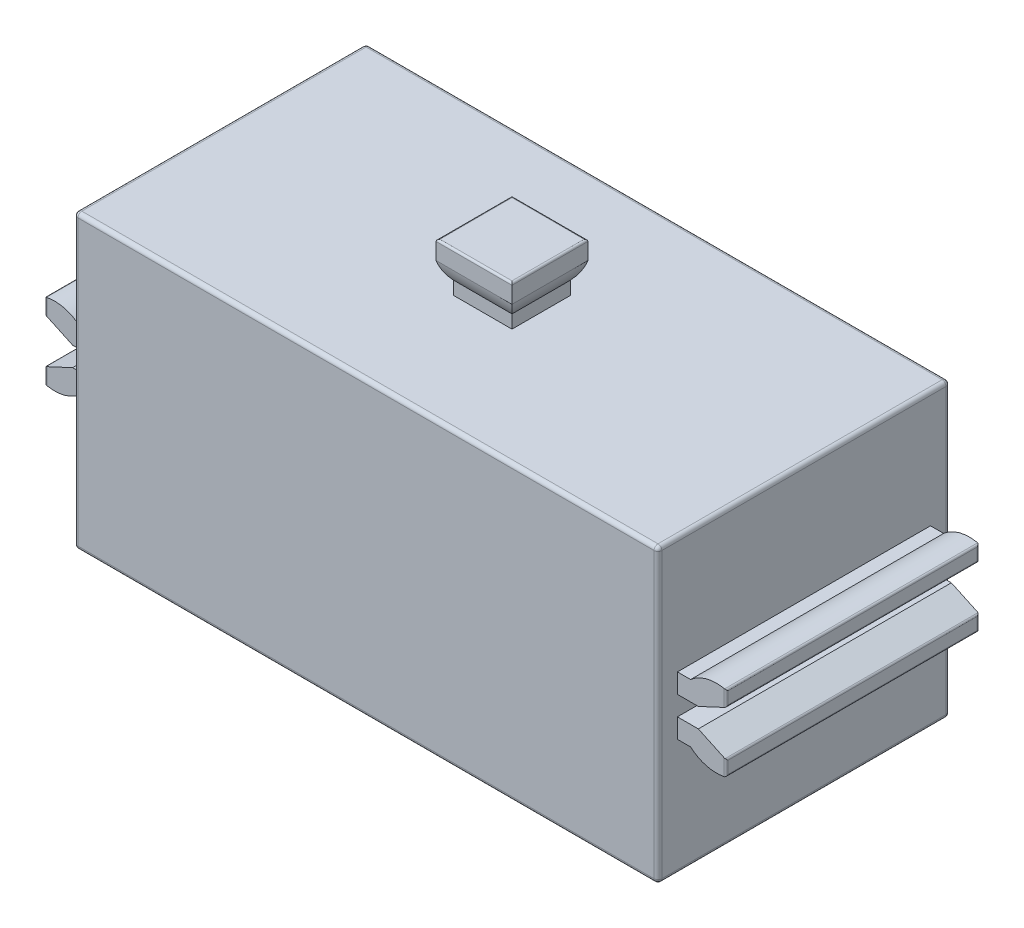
ISO-10303-21;
HEADER;
FILE_DESCRIPTION(('STEP AP214'),'2;1');
FILE_NAME('part.step','',(''),(''),'','','');
FILE_SCHEMA(('AUTOMOTIVE_DESIGN { 1 0 10303 214 1 1 1 1 }'));
ENDSEC;
DATA;
#1=APPLICATION_CONTEXT('core data for automotive mechanical design processes');
#2=APPLICATION_PROTOCOL_DEFINITION('international standard','automotive_design',2000,#1);
#3=PRODUCT_CONTEXT('',#1,'mechanical');
#4=PRODUCT('Part','Part','',(#3));
#5=PRODUCT_RELATED_PRODUCT_CATEGORY('part','',(#4));
#6=PRODUCT_DEFINITION_FORMATION('','',#4);
#7=PRODUCT_DEFINITION_CONTEXT('part definition',#1,'design');
#8=PRODUCT_DEFINITION('design','',#6,#7);
#9=PRODUCT_DEFINITION_SHAPE('','',#8);
#10=(LENGTH_UNIT() NAMED_UNIT(*) SI_UNIT(.MILLI.,.METRE.));
#11=(NAMED_UNIT(*) PLANE_ANGLE_UNIT() SI_UNIT($,.RADIAN.));
#12=(NAMED_UNIT(*) SI_UNIT($,.STERADIAN.) SOLID_ANGLE_UNIT());
#13=UNCERTAINTY_MEASURE_WITH_UNIT(LENGTH_MEASURE(1.E-05),#10,'distance_accuracy_value','');
#14=(GEOMETRIC_REPRESENTATION_CONTEXT(3) GLOBAL_UNCERTAINTY_ASSIGNED_CONTEXT((#13)) GLOBAL_UNIT_ASSIGNED_CONTEXT((#10,
#11,#12)) REPRESENTATION_CONTEXT('',''));
#15=CARTESIAN_POINT('',(0.,0.,0.));
#16=DIRECTION('',(0.,0.,1.));
#17=DIRECTION('',(1.,0.,0.));
#18=AXIS2_PLACEMENT_3D('',#15,#16,#17);
#19=CARTESIAN_POINT('',(5.,-7.5,4.));
#20=DIRECTION('',(0.,0.,1.));
#21=DIRECTION('',(1.,0.,0.));
#22=AXIS2_PLACEMENT_3D('',#19,#20,#21);
#23=SPHERICAL_SURFACE('',#22,2.);
#24=CARTESIAN_POINT('',(5.,-7.5,6.));
#25=VERTEX_POINT('',#24);
#26=VERTEX_LOOP('',#25);
#27=FACE_BOUND('',#26,.T.);
#28=ADVANCED_FACE('F39',(#27),#23,.T.);
#29=CLOSED_SHELL('',(#28));
#30=MANIFOLD_SOLID_BREP('B2',#29);
#31=CARTESIAN_POINT('',(-5.,-7.5,4.));
#32=DIRECTION('',(0.,0.,1.));
#33=DIRECTION('',(1.,0.,0.));
#34=AXIS2_PLACEMENT_3D('',#31,#32,#33);
#35=SPHERICAL_SURFACE('',#34,2.);
#36=CARTESIAN_POINT('',(-5.,-7.5,6.));
#37=VERTEX_POINT('',#36);
#38=VERTEX_LOOP('',#37);
#39=FACE_BOUND('',#38,.T.);
#40=ADVANCED_FACE('F62',(#39),#35,.T.);
#41=CLOSED_SHELL('',(#40));
#42=MANIFOLD_SOLID_BREP('B6',#41);
#43=CARTESIAN_POINT('',(3.25,-6.5,-2.));
#44=DIRECTION('',(0.,-1.,0.));
#45=DIRECTION('',(0.,0.,-1.));
#46=AXIS2_PLACEMENT_3D('',#43,#44,#45);
#47=PLANE('',#46);
#48=DIRECTION('',(-1.,0.,0.));
#49=VECTOR('',#48,1.);
#50=CARTESIAN_POINT('',(6.75,-6.5,-2.));
#51=LINE('',#50,#49);
#52=CARTESIAN_POINT('',(6.75,-6.5,-2.));
#53=VERTEX_POINT('',#52);
#54=CARTESIAN_POINT('',(3.25,-6.5,-2.));
#55=VERTEX_POINT('',#54);
#56=EDGE_CURVE('E522',#53,#55,#51,.T.);
#57=ORIENTED_EDGE('',*,*,#56,.T.);
#58=DIRECTION('',(0.,0.,-1.));
#59=VECTOR('',#58,1.);
#60=CARTESIAN_POINT('',(3.25,-6.5,-2.));
#61=LINE('',#60,#59);
#62=CARTESIAN_POINT('',(3.25,-6.5,-5.79322255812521));
#63=VERTEX_POINT('',#62);
#64=EDGE_CURVE('E533',#55,#63,#61,.T.);
#65=ORIENTED_EDGE('',*,*,#64,.T.);
#66=DIRECTION('',(1.,0.,0.));
#67=VECTOR('',#66,1.);
#68=CARTESIAN_POINT('',(6.75,-6.5,-5.79322255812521));
#69=LINE('',#68,#67);
#70=CARTESIAN_POINT('',(6.75,-6.5,-5.79322255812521));
#71=VERTEX_POINT('',#70);
#72=EDGE_CURVE('E538',#63,#71,#69,.T.);
#73=ORIENTED_EDGE('',*,*,#72,.T.);
#74=DIRECTION('',(0.,0.,1.));
#75=VECTOR('',#74,1.);
#76=CARTESIAN_POINT('',(6.75,-6.5,-2.));
#77=LINE('',#76,#75);
#78=EDGE_CURVE('E530',#71,#53,#77,.T.);
#79=ORIENTED_EDGE('',*,*,#78,.T.);
#80=EDGE_LOOP('',(#57,#65,#73,#79));
#81=FACE_BOUND('',#80,.T.);
#82=CARTESIAN_POINT('',(5.,-6.5,-4.));
#83=DIRECTION('',(0.,-1.,0.));
#84=DIRECTION('',(0.,0.,-1.));
#85=AXIS2_PLACEMENT_3D('',#82,#83,#84);
#86=CIRCLE('',#85,0.749999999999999);
#87=CARTESIAN_POINT('',(5.,-6.5,-4.75));
#88=VERTEX_POINT('',#87);
#89=EDGE_CURVE('E821',#88,#88,#86,.F.);
#90=ORIENTED_EDGE('',*,*,#89,.T.);
#91=EDGE_LOOP('',(#90));
#92=FACE_BOUND('',#91,.T.);
#93=ADVANCED_FACE('F76',(#81,#92),#47,.T.);
#94=CARTESIAN_POINT('',(-6.75,-6.5,-5.79322255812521));
#95=DIRECTION('',(0.,-1.,0.));
#96=DIRECTION('',(0.,0.,-1.));
#97=AXIS2_PLACEMENT_3D('',#94,#95,#96);
#98=PLANE('',#97);
#99=DIRECTION('',(0.,0.,-1.));
#100=VECTOR('',#99,1.);
#101=CARTESIAN_POINT('',(-6.75,-6.5,-2.));
#102=LINE('',#101,#100);
#103=CARTESIAN_POINT('',(-6.75,-6.5,-2.));
#104=VERTEX_POINT('',#103);
#105=CARTESIAN_POINT('',(-6.75,-6.5,-5.79322255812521));
#106=VERTEX_POINT('',#105);
#107=EDGE_CURVE('E562',#104,#106,#102,.T.);
#108=ORIENTED_EDGE('',*,*,#107,.T.);
#109=DIRECTION('',(1.,0.,0.));
#110=VECTOR('',#109,1.);
#111=CARTESIAN_POINT('',(-6.75,-6.5,-5.79322255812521));
#112=LINE('',#111,#110);
#113=CARTESIAN_POINT('',(-3.25,-6.5,-5.79322255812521));
#114=VERTEX_POINT('',#113);
#115=EDGE_CURVE('E565',#106,#114,#112,.T.);
#116=ORIENTED_EDGE('',*,*,#115,.T.);
#117=DIRECTION('',(0.,0.,1.));
#118=VECTOR('',#117,1.);
#119=CARTESIAN_POINT('',(-3.25,-6.5,-2.));
#120=LINE('',#119,#118);
#121=CARTESIAN_POINT('',(-3.25,-6.5,-2.));
#122=VERTEX_POINT('',#121);
#123=EDGE_CURVE('E569',#114,#122,#120,.T.);
#124=ORIENTED_EDGE('',*,*,#123,.T.);
#125=DIRECTION('',(-1.,0.,0.));
#126=VECTOR('',#125,1.);
#127=CARTESIAN_POINT('',(-6.75,-6.5,-2.));
#128=LINE('',#127,#126);
#129=EDGE_CURVE('E572',#122,#104,#128,.T.);
#130=ORIENTED_EDGE('',*,*,#129,.T.);
#131=EDGE_LOOP('',(#108,#116,#124,#130));
#132=FACE_BOUND('',#131,.T.);
#133=CARTESIAN_POINT('',(-5.,-6.5,-4.));
#134=DIRECTION('',(0.,-1.,0.));
#135=DIRECTION('',(0.,0.,-1.));
#136=AXIS2_PLACEMENT_3D('',#133,#134,#135);
#137=CIRCLE('',#136,0.749999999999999);
#138=CARTESIAN_POINT('',(-5.,-6.5,-4.75));
#139=VERTEX_POINT('',#138);
#140=EDGE_CURVE('E552',#139,#139,#137,.F.);
#141=ORIENTED_EDGE('',*,*,#140,.T.);
#142=EDGE_LOOP('',(#141));
#143=FACE_BOUND('',#142,.T.);
#144=ADVANCED_FACE('F1288',(#132,#143),#98,.T.);
#145=CARTESIAN_POINT('',(-15.,7.5,-7.5));
#146=DIRECTION('',(0.,1.,0.));
#147=DIRECTION('',(0.,0.,1.));
#148=AXIS2_PLACEMENT_3D('',#145,#146,#147);
#149=PLANE('',#148);
#150=DIRECTION('',(-1.,0.,0.));
#151=VECTOR('',#150,1.);
#152=CARTESIAN_POINT('',(-15.,7.5,-7.3));
#153=LINE('',#152,#151);
#154=CARTESIAN_POINT('',(14.8,7.5,-7.3));
#155=VERTEX_POINT('',#154);
#156=CARTESIAN_POINT('',(-14.8,7.5,-7.3));
#157=VERTEX_POINT('',#156);
#158=EDGE_CURVE('E1126',#155,#157,#153,.T.);
#159=ORIENTED_EDGE('',*,*,#158,.T.);
#160=DIRECTION('',(0.,0.,1.));
#161=VECTOR('',#160,1.);
#162=CARTESIAN_POINT('',(-14.8,7.5,-7.5));
#163=LINE('',#162,#161);
#164=CARTESIAN_POINT('',(-14.8,7.5,7.3));
#165=VERTEX_POINT('',#164);
#166=EDGE_CURVE('E1129',#157,#165,#163,.T.);
#167=ORIENTED_EDGE('',*,*,#166,.T.);
#168=DIRECTION('',(-1.,0.,0.));
#169=VECTOR('',#168,1.);
#170=CARTESIAN_POINT('',(15.,7.5,7.3));
#171=LINE('',#170,#169);
#172=CARTESIAN_POINT('',(14.8,7.5,7.3));
#173=VERTEX_POINT('',#172);
#174=EDGE_CURVE('E1124',#165,#173,#171,.F.);
#175=ORIENTED_EDGE('',*,*,#174,.T.);
#176=DIRECTION('',(0.,0.,1.));
#177=VECTOR('',#176,1.);
#178=CARTESIAN_POINT('',(14.8,7.5,-7.5));
#179=LINE('',#178,#177);
#180=EDGE_CURVE('E1122',#173,#155,#179,.F.);
#181=ORIENTED_EDGE('',*,*,#180,.T.);
#182=EDGE_LOOP('',(#159,#167,#175,#181));
#183=FACE_BOUND('',#182,.T.);
#184=DIRECTION('',(1.,0.,0.));
#185=VECTOR('',#184,1.);
#186=CARTESIAN_POINT('',(-1.5,7.5,1.5));
#187=LINE('',#186,#185);
#188=CARTESIAN_POINT('',(-1.5,7.5,1.5));
#189=VERTEX_POINT('',#188);
#190=CARTESIAN_POINT('',(1.5,7.5,1.5));
#191=VERTEX_POINT('',#190);
#192=EDGE_CURVE('E649',#189,#191,#187,.T.);
#193=ORIENTED_EDGE('',*,*,#192,.F.);
#194=DIRECTION('',(0.,0.,1.));
#195=VECTOR('',#194,1.);
#196=CARTESIAN_POINT('',(-1.5,7.5,-1.5));
#197=LINE('',#196,#195);
#198=CARTESIAN_POINT('',(-1.5,7.5,-1.5));
#199=VERTEX_POINT('',#198);
#200=EDGE_CURVE('E646',#199,#189,#197,.T.);
#201=ORIENTED_EDGE('',*,*,#200,.F.);
#202=DIRECTION('',(-1.,0.,0.));
#203=VECTOR('',#202,1.);
#204=CARTESIAN_POINT('',(-1.5,7.5,-1.5));
#205=LINE('',#204,#203);
#206=CARTESIAN_POINT('',(1.5,7.5,-1.5));
#207=VERTEX_POINT('',#206);
#208=EDGE_CURVE('E655',#207,#199,#205,.T.);
#209=ORIENTED_EDGE('',*,*,#208,.F.);
#210=DIRECTION('',(0.,0.,-1.));
#211=VECTOR('',#210,1.);
#212=CARTESIAN_POINT('',(1.5,7.5,-1.5));
#213=LINE('',#212,#211);
#214=EDGE_CURVE('E652',#191,#207,#213,.T.);
#215=ORIENTED_EDGE('',*,*,#214,.F.);
#216=EDGE_LOOP('',(#193,#201,#209,#215));
#217=FACE_BOUND('',#216,.T.);
#218=ADVANCED_FACE('F1256',(#183,#217),#149,.T.);
#219=CARTESIAN_POINT('',(-15.,-7.5,-7.5));
#220=DIRECTION('',(-1.,0.,0.));
#221=DIRECTION('',(0.,0.,1.));
#222=AXIS2_PLACEMENT_3D('',#219,#220,#221);
#223=PLANE('',#222);
#224=DIRECTION('',(0.,-1.,0.));
#225=VECTOR('',#224,1.);
#226=CARTESIAN_POINT('',(-15.,-7.5,-7.3));
#227=LINE('',#226,#225);
#228=CARTESIAN_POINT('',(-15.,7.3,-7.3));
#229=VERTEX_POINT('',#228);
#230=CARTESIAN_POINT('',(-15.,-7.3,-7.3));
#231=VERTEX_POINT('',#230);
#232=EDGE_CURVE('E1135',#229,#231,#227,.T.);
#233=ORIENTED_EDGE('',*,*,#232,.T.);
#234=DIRECTION('',(0.,0.,1.));
#235=VECTOR('',#234,1.);
#236=CARTESIAN_POINT('',(-15.,-7.3,-7.5));
#237=LINE('',#236,#235);
#238=CARTESIAN_POINT('',(-15.,-7.3,7.3));
#239=VERTEX_POINT('',#238);
#240=EDGE_CURVE('E1138',#231,#239,#237,.T.);
#241=ORIENTED_EDGE('',*,*,#240,.T.);
#242=DIRECTION('',(0.,-1.,0.));
#243=VECTOR('',#242,1.);
#244=CARTESIAN_POINT('',(-15.,7.5,7.3));
#245=LINE('',#244,#243);
#246=CARTESIAN_POINT('',(-15.,7.3,7.3));
#247=VERTEX_POINT('',#246);
#248=EDGE_CURVE('E1133',#239,#247,#245,.F.);
#249=ORIENTED_EDGE('',*,*,#248,.T.);
#250=DIRECTION('',(0.,0.,1.));
#251=VECTOR('',#250,1.);
#252=CARTESIAN_POINT('',(-15.,7.3,-7.5));
#253=LINE('',#252,#251);
#254=EDGE_CURVE('E1131',#247,#229,#253,.F.);
#255=ORIENTED_EDGE('',*,*,#254,.T.);
#256=EDGE_LOOP('',(#233,#241,#249,#255));
#257=FACE_BOUND('',#256,.T.);
#258=DIRECTION('',(0.,0.,1.));
#259=VECTOR('',#258,1.);
#260=CARTESIAN_POINT('',(-15.,-1.5,-6.5));
#261=LINE('',#260,#259);
#262=CARTESIAN_POINT('',(-15.,-1.5,-6.5));
#263=VERTEX_POINT('',#262);
#264=CARTESIAN_POINT('',(-15.,-1.5,6.5));
#265=VERTEX_POINT('',#264);
#266=EDGE_CURVE('E809',#263,#265,#261,.T.);
#267=ORIENTED_EDGE('',*,*,#266,.F.);
#268=DIRECTION('',(0.,1.,0.));
#269=VECTOR('',#268,1.);
#270=CARTESIAN_POINT('',(-15.,-0.5,-6.5));
#271=LINE('',#270,#269);
#272=CARTESIAN_POINT('',(-15.,-0.5,-6.5));
#273=VERTEX_POINT('',#272);
#274=EDGE_CURVE('E791',#263,#273,#271,.T.);
#275=ORIENTED_EDGE('',*,*,#274,.T.);
#276=DIRECTION('',(0.,0.,1.));
#277=VECTOR('',#276,1.);
#278=CARTESIAN_POINT('',(-15.,-0.5,-6.5));
#279=LINE('',#278,#277);
#280=CARTESIAN_POINT('',(-15.,-0.5,6.5));
#281=VERTEX_POINT('',#280);
#282=EDGE_CURVE('E806',#273,#281,#279,.T.);
#283=ORIENTED_EDGE('',*,*,#282,.T.);
#284=DIRECTION('',(0.,1.,0.));
#285=VECTOR('',#284,1.);
#286=CARTESIAN_POINT('',(-15.,-0.5,6.5));
#287=LINE('',#286,#285);
#288=EDGE_CURVE('E783',#265,#281,#287,.T.);
#289=ORIENTED_EDGE('',*,*,#288,.F.);
#290=EDGE_LOOP('',(#267,#275,#283,#289));
#291=FACE_BOUND('',#290,.T.);
#292=DIRECTION('',(0.,0.,1.));
#293=VECTOR('',#292,1.);
#294=CARTESIAN_POINT('',(-15.,0.5,-6.5));
#295=LINE('',#294,#293);
#296=CARTESIAN_POINT('',(-15.,0.5,-6.5));
#297=VERTEX_POINT('',#296);
#298=CARTESIAN_POINT('',(-15.,0.5,6.5));
#299=VERTEX_POINT('',#298);
#300=EDGE_CURVE('E769',#297,#299,#295,.T.);
#301=ORIENTED_EDGE('',*,*,#300,.F.);
#302=DIRECTION('',(0.,1.,0.));
#303=VECTOR('',#302,1.);
#304=CARTESIAN_POINT('',(-15.,1.5,-6.5));
#305=LINE('',#304,#303);
#306=CARTESIAN_POINT('',(-15.,1.5,-6.5));
#307=VERTEX_POINT('',#306);
#308=EDGE_CURVE('E742',#297,#307,#305,.T.);
#309=ORIENTED_EDGE('',*,*,#308,.T.);
#310=DIRECTION('',(0.,0.,1.));
#311=VECTOR('',#310,1.);
#312=CARTESIAN_POINT('',(-15.,1.5,-6.5));
#313=LINE('',#312,#311);
#314=CARTESIAN_POINT('',(-15.,1.5,6.5));
#315=VERTEX_POINT('',#314);
#316=EDGE_CURVE('E756',#307,#315,#313,.T.);
#317=ORIENTED_EDGE('',*,*,#316,.T.);
#318=DIRECTION('',(0.,1.,0.));
#319=VECTOR('',#318,1.);
#320=CARTESIAN_POINT('',(-15.,1.5,6.5));
#321=LINE('',#320,#319);
#322=EDGE_CURVE('E733',#299,#315,#321,.T.);
#323=ORIENTED_EDGE('',*,*,#322,.F.);
#324=EDGE_LOOP('',(#301,#309,#317,#323));
#325=FACE_BOUND('',#324,.T.);
#326=ADVANCED_FACE('F1225',(#257,#291,#325),#223,.T.);
#327=CARTESIAN_POINT('',(15.,-7.5,-7.5));
#328=DIRECTION('',(1.,0.,0.));
#329=DIRECTION('',(0.,0.,-1.));
#330=AXIS2_PLACEMENT_3D('',#327,#328,#329);
#331=PLANE('',#330);
#332=DIRECTION('',(0.,1.,0.));
#333=VECTOR('',#332,1.);
#334=CARTESIAN_POINT('',(15.,-7.5,-7.3));
#335=LINE('',#334,#333);
#336=CARTESIAN_POINT('',(15.,-7.3,-7.3));
#337=VERTEX_POINT('',#336);
#338=CARTESIAN_POINT('',(15.,7.3,-7.3));
#339=VERTEX_POINT('',#338);
#340=EDGE_CURVE('E1117',#337,#339,#335,.T.);
#341=ORIENTED_EDGE('',*,*,#340,.T.);
#342=DIRECTION('',(0.,0.,1.));
#343=VECTOR('',#342,1.);
#344=CARTESIAN_POINT('',(15.,7.3,-7.5));
#345=LINE('',#344,#343);
#346=CARTESIAN_POINT('',(15.,7.3,7.3));
#347=VERTEX_POINT('',#346);
#348=EDGE_CURVE('E1120',#339,#347,#345,.T.);
#349=ORIENTED_EDGE('',*,*,#348,.T.);
#350=DIRECTION('',(0.,1.,0.));
#351=VECTOR('',#350,1.);
#352=CARTESIAN_POINT('',(15.,-7.5,7.3));
#353=LINE('',#352,#351);
#354=CARTESIAN_POINT('',(15.,-7.3,7.3));
#355=VERTEX_POINT('',#354);
#356=EDGE_CURVE('E1115',#347,#355,#353,.F.);
#357=ORIENTED_EDGE('',*,*,#356,.T.);
#358=DIRECTION('',(0.,0.,1.));
#359=VECTOR('',#358,1.);
#360=CARTESIAN_POINT('',(15.,-7.3,-7.5));
#361=LINE('',#360,#359);
#362=EDGE_CURVE('E1113',#355,#337,#361,.F.);
#363=ORIENTED_EDGE('',*,*,#362,.T.);
#364=EDGE_LOOP('',(#341,#349,#357,#363));
#365=FACE_BOUND('',#364,.T.);
#366=DIRECTION('',(0.,-1.,0.));
#367=VECTOR('',#366,1.);
#368=CARTESIAN_POINT('',(15.,1.5,-6.5));
#369=LINE('',#368,#367);
#370=CARTESIAN_POINT('',(15.,1.5,-6.5));
#371=VERTEX_POINT('',#370);
#372=CARTESIAN_POINT('',(15.,0.5,-6.5));
#373=VERTEX_POINT('',#372);
#374=EDGE_CURVE('E673',#371,#373,#369,.T.);
#375=ORIENTED_EDGE('',*,*,#374,.T.);
#376=DIRECTION('',(0.,0.,1.));
#377=VECTOR('',#376,1.);
#378=CARTESIAN_POINT('',(15.,0.5,-6.5));
#379=LINE('',#378,#377);
#380=CARTESIAN_POINT('',(15.,0.5,6.5));
#381=VERTEX_POINT('',#380);
#382=EDGE_CURVE('E697',#373,#381,#379,.T.);
#383=ORIENTED_EDGE('',*,*,#382,.T.);
#384=DIRECTION('',(0.,-1.,0.));
#385=VECTOR('',#384,1.);
#386=CARTESIAN_POINT('',(15.,1.5,6.5));
#387=LINE('',#386,#385);
#388=CARTESIAN_POINT('',(15.,1.5,6.5));
#389=VERTEX_POINT('',#388);
#390=EDGE_CURVE('E686',#389,#381,#387,.T.);
#391=ORIENTED_EDGE('',*,*,#390,.F.);
#392=DIRECTION('',(0.,0.,1.));
#393=VECTOR('',#392,1.);
#394=CARTESIAN_POINT('',(15.,1.5,-6.5));
#395=LINE('',#394,#393);
#396=EDGE_CURVE('E700',#371,#389,#395,.T.);
#397=ORIENTED_EDGE('',*,*,#396,.F.);
#398=EDGE_LOOP('',(#375,#383,#391,#397));
#399=FACE_BOUND('',#398,.T.);
#400=DIRECTION('',(0.,-1.,0.));
#401=VECTOR('',#400,1.);
#402=CARTESIAN_POINT('',(15.,-0.5,-6.5));
#403=LINE('',#402,#401);
#404=CARTESIAN_POINT('',(15.,-0.5,-6.5));
#405=VERTEX_POINT('',#404);
#406=CARTESIAN_POINT('',(15.,-1.5,-6.5));
#407=VERTEX_POINT('',#406);
#408=EDGE_CURVE('E714',#405,#407,#403,.T.);
#409=ORIENTED_EDGE('',*,*,#408,.T.);
#410=DIRECTION('',(0.,0.,1.));
#411=VECTOR('',#410,1.);
#412=CARTESIAN_POINT('',(15.,-1.5,-6.5));
#413=LINE('',#412,#411);
#414=CARTESIAN_POINT('',(15.,-1.5,6.5));
#415=VERTEX_POINT('',#414);
#416=EDGE_CURVE('E734',#407,#415,#413,.T.);
#417=ORIENTED_EDGE('',*,*,#416,.T.);
#418=DIRECTION('',(0.,-1.,0.));
#419=VECTOR('',#418,1.);
#420=CARTESIAN_POINT('',(15.,-0.5,6.5));
#421=LINE('',#420,#419);
#422=CARTESIAN_POINT('',(15.,-0.5,6.5));
#423=VERTEX_POINT('',#422);
#424=EDGE_CURVE('E727',#423,#415,#421,.T.);
#425=ORIENTED_EDGE('',*,*,#424,.F.);
#426=DIRECTION('',(0.,0.,1.));
#427=VECTOR('',#426,1.);
#428=CARTESIAN_POINT('',(15.,-0.5,-6.5));
#429=LINE('',#428,#427);
#430=EDGE_CURVE('E737',#405,#423,#429,.T.);
#431=ORIENTED_EDGE('',*,*,#430,.F.);
#432=EDGE_LOOP('',(#409,#417,#425,#431));
#433=FACE_BOUND('',#432,.T.);
#434=ADVANCED_FACE('F1446',(#365,#399,#433),#331,.T.);
#435=CARTESIAN_POINT('',(-15.,-7.5,-7.5));
#436=DIRECTION('',(0.,-1.,0.));
#437=DIRECTION('',(0.,0.,-1.));
#438=AXIS2_PLACEMENT_3D('',#435,#436,#437);
#439=PLANE('',#438);
#440=DIRECTION('',(1.,0.,0.));
#441=VECTOR('',#440,1.);
#442=CARTESIAN_POINT('',(-15.,-7.5,7.3));
#443=LINE('',#442,#441);
#444=CARTESIAN_POINT('',(14.8,-7.5,7.3));
#445=VERTEX_POINT('',#444);
#446=CARTESIAN_POINT('',(-14.8,-7.5,7.3));
#447=VERTEX_POINT('',#446);
#448=EDGE_CURVE('E1097',#445,#447,#443,.F.);
#449=ORIENTED_EDGE('',*,*,#448,.T.);
#450=DIRECTION('',(0.,0.,1.));
#451=VECTOR('',#450,1.);
#452=CARTESIAN_POINT('',(-14.8,-7.5,-7.5));
#453=LINE('',#452,#451);
#454=CARTESIAN_POINT('',(-14.8,-7.5,-7.3));
#455=VERTEX_POINT('',#454);
#456=EDGE_CURVE('E1102',#447,#455,#453,.F.);
#457=ORIENTED_EDGE('',*,*,#456,.T.);
#458=DIRECTION('',(1.,0.,0.));
#459=VECTOR('',#458,1.);
#460=CARTESIAN_POINT('',(-15.,-7.5,-7.3));
#461=LINE('',#460,#459);
#462=CARTESIAN_POINT('',(14.8,-7.5,-7.3));
#463=VERTEX_POINT('',#462);
#464=EDGE_CURVE('E1099',#455,#463,#461,.T.);
#465=ORIENTED_EDGE('',*,*,#464,.T.);
#466=DIRECTION('',(0.,0.,1.));
#467=VECTOR('',#466,1.);
#468=CARTESIAN_POINT('',(14.8,-7.5,-7.5));
#469=LINE('',#468,#467);
#470=EDGE_CURVE('E1046',#463,#445,#469,.T.);
#471=ORIENTED_EDGE('',*,*,#470,.T.);
#472=EDGE_LOOP('',(#449,#457,#465,#471));
#473=FACE_BOUND('',#472,.T.);
#474=DIRECTION('',(-1.,0.,0.));
#475=VECTOR('',#474,1.);
#476=CARTESIAN_POINT('',(6.75,-7.5,-2.));
#477=LINE('',#476,#475);
#478=CARTESIAN_POINT('',(6.75,-7.5,-2.));
#479=VERTEX_POINT('',#478);
#480=CARTESIAN_POINT('',(3.25,-7.5,-2.));
#481=VERTEX_POINT('',#480);
#482=EDGE_CURVE('E525',#479,#481,#477,.T.);
#483=ORIENTED_EDGE('',*,*,#482,.F.);
#484=DIRECTION('',(0.,0.,1.));
#485=VECTOR('',#484,1.);
#486=CARTESIAN_POINT('',(6.75,-7.5,-2.));
#487=LINE('',#486,#485);
#488=CARTESIAN_POINT('',(6.75,-7.5,-5.79322255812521));
#489=VERTEX_POINT('',#488);
#490=EDGE_CURVE('E542',#489,#479,#487,.T.);
#491=ORIENTED_EDGE('',*,*,#490,.F.);
#492=DIRECTION('',(1.,0.,0.));
#493=VECTOR('',#492,1.);
#494=CARTESIAN_POINT('',(6.75,-7.5,-5.79322255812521));
#495=LINE('',#494,#493);
#496=CARTESIAN_POINT('',(3.25,-7.5,-5.79322255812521));
#497=VERTEX_POINT('',#496);
#498=EDGE_CURVE('E545',#497,#489,#495,.T.);
#499=ORIENTED_EDGE('',*,*,#498,.F.);
#500=DIRECTION('',(0.,0.,-1.));
#501=VECTOR('',#500,1.);
#502=CARTESIAN_POINT('',(3.25,-7.5,-2.));
#503=LINE('',#502,#501);
#504=EDGE_CURVE('E551',#481,#497,#503,.T.);
#505=ORIENTED_EDGE('',*,*,#504,.F.);
#506=EDGE_LOOP('',(#483,#491,#499,#505));
#507=FACE_BOUND('',#506,.T.);
#508=DIRECTION('',(0.,0.,-1.));
#509=VECTOR('',#508,1.);
#510=CARTESIAN_POINT('',(-6.75,-7.5,-2.));
#511=LINE('',#510,#509);
#512=CARTESIAN_POINT('',(-6.75,-7.5,-2.));
#513=VERTEX_POINT('',#512);
#514=CARTESIAN_POINT('',(-6.75,-7.5,-5.79322255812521));
#515=VERTEX_POINT('',#514);
#516=EDGE_CURVE('E558',#513,#515,#511,.T.);
#517=ORIENTED_EDGE('',*,*,#516,.F.);
#518=DIRECTION('',(-1.,0.,0.));
#519=VECTOR('',#518,1.);
#520=CARTESIAN_POINT('',(-6.75,-7.5,-2.));
#521=LINE('',#520,#519);
#522=CARTESIAN_POINT('',(-3.25,-7.5,-2.));
#523=VERTEX_POINT('',#522);
#524=EDGE_CURVE('E566',#523,#513,#521,.T.);
#525=ORIENTED_EDGE('',*,*,#524,.F.);
#526=DIRECTION('',(0.,0.,1.));
#527=VECTOR('',#526,1.);
#528=CARTESIAN_POINT('',(-3.25,-7.5,-2.));
#529=LINE('',#528,#527);
#530=CARTESIAN_POINT('',(-3.25,-7.5,-5.79322255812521));
#531=VERTEX_POINT('',#530);
#532=EDGE_CURVE('E580',#531,#523,#529,.T.);
#533=ORIENTED_EDGE('',*,*,#532,.F.);
#534=DIRECTION('',(1.,0.,0.));
#535=VECTOR('',#534,1.);
#536=CARTESIAN_POINT('',(-6.75,-7.5,-5.79322255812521));
#537=LINE('',#536,#535);
#538=EDGE_CURVE('E577',#515,#531,#537,.T.);
#539=ORIENTED_EDGE('',*,*,#538,.F.);
#540=EDGE_LOOP('',(#517,#525,#533,#539));
#541=FACE_BOUND('',#540,.T.);
#542=CARTESIAN_POINT('',(5.,-7.5,4.));
#543=DIRECTION('',(0.,-1.,0.));
#544=DIRECTION('',(0.,0.,-1.));
#545=AXIS2_PLACEMENT_3D('',#542,#543,#544);
#546=CIRCLE('',#545,2.25);
#547=CARTESIAN_POINT('',(5.,-7.5,1.75));
#548=VERTEX_POINT('',#547);
#549=EDGE_CURVE('E587',#548,#548,#546,.T.);
#550=ORIENTED_EDGE('',*,*,#549,.F.);
#551=EDGE_LOOP('',(#550));
#552=FACE_BOUND('',#551,.T.);
#553=CARTESIAN_POINT('',(-5.,-7.5,4.));
#554=DIRECTION('',(0.,-1.,0.));
#555=DIRECTION('',(0.,0.,-1.));
#556=AXIS2_PLACEMENT_3D('',#553,#554,#555);
#557=CIRCLE('',#556,2.25);
#558=CARTESIAN_POINT('',(-5.,-7.5,1.75));
#559=VERTEX_POINT('',#558);
#560=EDGE_CURVE('E597',#559,#559,#557,.T.);
#561=ORIENTED_EDGE('',*,*,#560,.F.);
#562=EDGE_LOOP('',(#561));
#563=FACE_BOUND('',#562,.T.);
#564=ADVANCED_FACE('F1449',(#473,#507,#541,#552,#563),#439,.T.);
#565=CARTESIAN_POINT('',(-15.,7.5,-7.5));
#566=DIRECTION('',(0.,0.,-1.));
#567=DIRECTION('',(-1.,0.,0.));
#568=AXIS2_PLACEMENT_3D('',#565,#566,#567);
#569=PLANE('',#568);
#570=DIRECTION('',(0.,1.,0.));
#571=VECTOR('',#570,1.);
#572=CARTESIAN_POINT('',(14.8,7.5,-7.5));
#573=LINE('',#572,#571);
#574=CARTESIAN_POINT('',(14.8,7.3,-7.5));
#575=VERTEX_POINT('',#574);
#576=CARTESIAN_POINT('',(14.8,-7.3,-7.5));
#577=VERTEX_POINT('',#576);
#578=EDGE_CURVE('E1108',#575,#577,#573,.F.);
#579=ORIENTED_EDGE('',*,*,#578,.T.);
#580=DIRECTION('',(1.,0.,0.));
#581=VECTOR('',#580,1.);
#582=CARTESIAN_POINT('',(-15.,-7.3,-7.5));
#583=LINE('',#582,#581);
#584=CARTESIAN_POINT('',(-14.8,-7.3,-7.5));
#585=VERTEX_POINT('',#584);
#586=EDGE_CURVE('E1110',#577,#585,#583,.F.);
#587=ORIENTED_EDGE('',*,*,#586,.T.);
#588=DIRECTION('',(0.,-1.,0.));
#589=VECTOR('',#588,1.);
#590=CARTESIAN_POINT('',(-14.8,7.5,-7.5));
#591=LINE('',#590,#589);
#592=CARTESIAN_POINT('',(-14.8,7.3,-7.5));
#593=VERTEX_POINT('',#592);
#594=EDGE_CURVE('E1104',#585,#593,#591,.F.);
#595=ORIENTED_EDGE('',*,*,#594,.T.);
#596=DIRECTION('',(-1.,0.,0.));
#597=VECTOR('',#596,1.);
#598=CARTESIAN_POINT('',(-15.,7.3,-7.5));
#599=LINE('',#598,#597);
#600=EDGE_CURVE('E1106',#593,#575,#599,.F.);
#601=ORIENTED_EDGE('',*,*,#600,.T.);
#602=EDGE_LOOP('',(#579,#587,#595,#601));
#603=FACE_BOUND('',#602,.T.);
#604=ADVANCED_FACE('F1717',(#603),#569,.T.);
#605=CARTESIAN_POINT('',(-15.,7.5,7.5));
#606=DIRECTION('',(0.,0.,-1.));
#607=DIRECTION('',(-1.,0.,0.));
#608=AXIS2_PLACEMENT_3D('',#605,#606,#607);
#609=PLANE('',#608);
#610=DIRECTION('',(0.,1.,0.));
#611=VECTOR('',#610,1.);
#612=CARTESIAN_POINT('',(14.8,7.5,7.5));
#613=LINE('',#612,#611);
#614=CARTESIAN_POINT('',(14.8,-7.3,7.5));
#615=VERTEX_POINT('',#614);
#616=CARTESIAN_POINT('',(14.8,7.3,7.5));
#617=VERTEX_POINT('',#616);
#618=EDGE_CURVE('E85',#615,#617,#613,.T.);
#619=ORIENTED_EDGE('',*,*,#618,.T.);
#620=DIRECTION('',(-1.,0.,0.));
#621=VECTOR('',#620,1.);
#622=CARTESIAN_POINT('',(-15.,7.3,7.5));
#623=LINE('',#622,#621);
#624=CARTESIAN_POINT('',(-14.8,7.3,7.5));
#625=VERTEX_POINT('',#624);
#626=EDGE_CURVE('E60',#617,#625,#623,.T.);
#627=ORIENTED_EDGE('',*,*,#626,.T.);
#628=DIRECTION('',(0.,-1.,0.));
#629=VECTOR('',#628,1.);
#630=CARTESIAN_POINT('',(-14.8,-7.5,7.5));
#631=LINE('',#630,#629);
#632=CARTESIAN_POINT('',(-14.8,-7.3,7.5));
#633=VERTEX_POINT('',#632);
#634=EDGE_CURVE('E1140',#625,#633,#631,.T.);
#635=ORIENTED_EDGE('',*,*,#634,.T.);
#636=DIRECTION('',(1.,0.,0.));
#637=VECTOR('',#636,1.);
#638=CARTESIAN_POINT('',(15.,-7.3,7.5));
#639=LINE('',#638,#637);
#640=EDGE_CURVE('E96',#633,#615,#639,.T.);
#641=ORIENTED_EDGE('',*,*,#640,.T.);
#642=EDGE_LOOP('',(#619,#627,#635,#641));
#643=FACE_BOUND('',#642,.T.);
#644=ADVANCED_FACE('F1233',(#643),#609,.F.);
#645=CARTESIAN_POINT('',(-15.,-0.5,-6.5));
#646=DIRECTION('',(0.,1.,0.));
#647=DIRECTION('',(-1.,0.,0.));
#648=AXIS2_PLACEMENT_3D('',#645,#646,#647);
#649=PLANE('',#648);
#650=DIRECTION('',(-1.,0.,0.));
#651=VECTOR('',#650,1.);
#652=CARTESIAN_POINT('',(-15.,-0.5,6.5));
#653=LINE('',#652,#651);
#654=CARTESIAN_POINT('',(-16.0722534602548,-0.5,6.5));
#655=VERTEX_POINT('',#654);
#656=EDGE_CURVE('E772',#281,#655,#653,.T.);
#657=ORIENTED_EDGE('',*,*,#656,.F.);
#658=ORIENTED_EDGE('',*,*,#282,.F.);
#659=DIRECTION('',(-1.,0.,0.));
#660=VECTOR('',#659,1.);
#661=CARTESIAN_POINT('',(-15.,-0.5,-6.5));
#662=LINE('',#661,#660);
#663=CARTESIAN_POINT('',(-16.0722534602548,-0.5,-6.5));
#664=VERTEX_POINT('',#663);
#665=EDGE_CURVE('E779',#273,#664,#662,.T.);
#666=ORIENTED_EDGE('',*,*,#665,.T.);
#667=DIRECTION('',(0.,0.,1.));
#668=VECTOR('',#667,1.);
#669=CARTESIAN_POINT('',(-16.0722534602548,-0.5,-6.5));
#670=LINE('',#669,#668);
#671=EDGE_CURVE('E793',#664,#655,#670,.T.);
#672=ORIENTED_EDGE('',*,*,#671,.T.);
#673=EDGE_LOOP('',(#657,#658,#666,#672));
#674=FACE_BOUND('',#673,.T.);
#675=ADVANCED_FACE('F1724',(#674),#649,.T.);
#676=CARTESIAN_POINT('',(-15.6771243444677,-1.5,-6.5));
#677=DIRECTION('',(0.,-1.,0.));
#678=DIRECTION('',(1.,0.,0.));
#679=AXIS2_PLACEMENT_3D('',#676,#677,#678);
#680=PLANE('',#679);
#681=DIRECTION('',(1.,0.,0.));
#682=VECTOR('',#681,1.);
#683=CARTESIAN_POINT('',(-15.6771243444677,-1.5,6.5));
#684=LINE('',#683,#682);
#685=CARTESIAN_POINT('',(-15.6771243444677,-1.5,6.5));
#686=VERTEX_POINT('',#685);
#687=EDGE_CURVE('E801',#686,#265,#684,.T.);
#688=ORIENTED_EDGE('',*,*,#687,.F.);
#689=DIRECTION('',(0.,0.,1.));
#690=VECTOR('',#689,1.);
#691=CARTESIAN_POINT('',(-15.6771243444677,-1.5,-6.5));
#692=LINE('',#691,#690);
#693=CARTESIAN_POINT('',(-15.6771243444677,-1.5,-6.5));
#694=VERTEX_POINT('',#693);
#695=EDGE_CURVE('E812',#694,#686,#692,.T.);
#696=ORIENTED_EDGE('',*,*,#695,.F.);
#697=DIRECTION('',(1.,0.,0.));
#698=VECTOR('',#697,1.);
#699=CARTESIAN_POINT('',(-15.6771243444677,-1.5,-6.5));
#700=LINE('',#699,#698);
#701=EDGE_CURVE('E788',#694,#263,#700,.T.);
#702=ORIENTED_EDGE('',*,*,#701,.T.);
#703=ORIENTED_EDGE('',*,*,#266,.T.);
#704=EDGE_LOOP('',(#688,#696,#702,#703));
#705=FACE_BOUND('',#704,.T.);
#706=ADVANCED_FACE('F1759',(#705),#680,.T.);
#707=CARTESIAN_POINT('',(-17.,0.,-6.5));
#708=DIRECTION('',(0.,0.,1.));
#709=DIRECTION('',(1.,0.,0.));
#710=AXIS2_PLACEMENT_3D('',#707,#708,#709);
#711=CYLINDRICAL_SURFACE('',#710,2.);
#712=DIRECTION('',(0.,0.,1.));
#713=VECTOR('',#712,1.);
#714=CARTESIAN_POINT('',(-17.4210526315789,-1.9551763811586,-6.5));
#715=LINE('',#714,#713);
#716=CARTESIAN_POINT('',(-17.4210526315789,-1.9551763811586,6.4977588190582));
#717=VERTEX_POINT('',#716);
#718=CARTESIAN_POINT('',(-17.4210526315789,-1.9551763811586,-6.4977588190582));
#719=VERTEX_POINT('',#718);
#720=EDGE_CURVE('E840',#717,#719,#715,.F.);
#721=ORIENTED_EDGE('',*,*,#720,.T.);
#722=CARTESIAN_POINT('',(-17.4210526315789,-1.9551763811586,-6.4977588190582));
#723=CARTESIAN_POINT('',(-17.4175857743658,-1.95592319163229,-6.49850458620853));
#724=CARTESIAN_POINT('',(-17.4140979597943,-1.95666454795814,-6.4990642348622));
#725=CARTESIAN_POINT('',(-17.4070804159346,-1.95813635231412,-6.49981129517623));
#726=CARTESIAN_POINT('',(-17.4035506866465,-1.95886680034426,-6.49999870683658));
#727=CARTESIAN_POINT('',(-17.4000000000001,-1.95959179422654,-6.50000000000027));
#728=B_SPLINE_CURVE_WITH_KNOTS('',3,(#722,#723,#724,#725,#726,#727),.UNSPECIFIED.,.F.,.F.,(4,2,
4),(0.,0.0108281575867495,0.0216563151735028),.UNSPECIFIED.);
#729=CARTESIAN_POINT('',(-17.4,-1.95959179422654,-6.5));
#730=VERTEX_POINT('',#729);
#731=EDGE_CURVE('E861',#719,#730,#728,.T.);
#732=ORIENTED_EDGE('',*,*,#731,.T.);
#733=CARTESIAN_POINT('',(-17.,0.,-6.5));
#734=DIRECTION('',(0.,0.,1.));
#735=DIRECTION('',(1.,0.,0.));
#736=AXIS2_PLACEMENT_3D('',#733,#734,#735);
#737=CIRCLE('',#736,2.);
#738=EDGE_CURVE('E786',#730,#694,#737,.T.);
#739=ORIENTED_EDGE('',*,*,#738,.T.);
#740=ORIENTED_EDGE('',*,*,#695,.T.);
#741=CARTESIAN_POINT('',(-17.,0.,6.5));
#742=DIRECTION('',(0.,0.,1.));
#743=DIRECTION('',(1.,0.,0.));
#744=AXIS2_PLACEMENT_3D('',#741,#742,#743);
#745=CIRCLE('',#744,2.);
#746=CARTESIAN_POINT('',(-17.4,-1.95959179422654,6.5));
#747=VERTEX_POINT('',#746);
#748=EDGE_CURVE('E799',#747,#686,#745,.T.);
#749=ORIENTED_EDGE('',*,*,#748,.F.);
#750=CARTESIAN_POINT('',(-17.4,-1.95959179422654,6.5));
#751=CARTESIAN_POINT('',(-17.4035506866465,-1.95886680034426,6.49999870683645));
#752=CARTESIAN_POINT('',(-17.4070804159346,-1.95813635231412,6.49981129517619));
#753=CARTESIAN_POINT('',(-17.4140979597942,-1.95666454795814,6.49906423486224));
#754=CARTESIAN_POINT('',(-17.4175857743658,-1.9559231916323,6.49850458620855));
#755=CARTESIAN_POINT('',(-17.4210526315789,-1.9551763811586,6.49775881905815));
#756=B_SPLINE_CURVE_WITH_KNOTS('',3,(#750,#751,#752,#753,#754,#755),.UNSPECIFIED.,.F.,.F.,(4,2,
4),(0.,0.0108281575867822,0.0216563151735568),.UNSPECIFIED.);
#757=EDGE_CURVE('E833',#747,#717,#756,.T.);
#758=ORIENTED_EDGE('',*,*,#757,.T.);
#759=EDGE_LOOP('',(#721,#732,#739,#740,#749,#758));
#760=FACE_BOUND('',#759,.T.);
#761=ADVANCED_FACE('F842',(#760),#711,.T.);
#762=CARTESIAN_POINT('',(-17.5,-1.16576914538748,-6.5));
#763=DIRECTION('',(-1.,0.,0.));
#764=DIRECTION('',(0.,0.,1.));
#765=AXIS2_PLACEMENT_3D('',#762,#763,#764);
#766=PLANE('',#765);
#767=DIRECTION('',(0.,-1.,0.));
#768=VECTOR('',#767,1.);
#769=CARTESIAN_POINT('',(-17.5,-1.93649167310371,-6.4));
#770=LINE('',#769,#768);
#771=CARTESIAN_POINT('',(-17.5,-1.22947617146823,-6.4));
#772=VERTEX_POINT('',#771);
#773=CARTESIAN_POINT('',(-17.5,-1.85741756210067,-6.4));
#774=VERTEX_POINT('',#773);
#775=EDGE_CURVE('E828',#772,#774,#770,.T.);
#776=ORIENTED_EDGE('',*,*,#775,.T.);
#777=DIRECTION('',(0.,0.,1.));
#778=VECTOR('',#777,1.);
#779=CARTESIAN_POINT('',(-17.5,-1.85741756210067,-6.5));
#780=LINE('',#779,#778);
#781=CARTESIAN_POINT('',(-17.5,-1.85741756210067,6.4));
#782=VERTEX_POINT('',#781);
#783=EDGE_CURVE('E830',#774,#782,#780,.T.);
#784=ORIENTED_EDGE('',*,*,#783,.T.);
#785=DIRECTION('',(0.,-1.,0.));
#786=VECTOR('',#785,1.);
#787=CARTESIAN_POINT('',(-17.5,-1.16576914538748,6.4));
#788=LINE('',#787,#786);
#789=CARTESIAN_POINT('',(-17.5,-1.22947617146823,6.4));
#790=VERTEX_POINT('',#789);
#791=EDGE_CURVE('E818',#782,#790,#788,.F.);
#792=ORIENTED_EDGE('',*,*,#791,.T.);
#793=DIRECTION('',(0.,0.,1.));
#794=VECTOR('',#793,1.);
#795=CARTESIAN_POINT('',(-17.5,-1.22947617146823,-6.5));
#796=LINE('',#795,#794);
#797=EDGE_CURVE('E826',#790,#772,#796,.F.);
#798=ORIENTED_EDGE('',*,*,#797,.T.);
#799=EDGE_LOOP('',(#776,#784,#792,#798));
#800=FACE_BOUND('',#799,.T.);
#801=ADVANCED_FACE('F1773',(#800),#766,.T.);
#802=CARTESIAN_POINT('',(-16.0722534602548,-0.5,-6.5));
#803=DIRECTION('',(-0.422618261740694,0.906307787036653,0.));
#804=DIRECTION('',(-0.906307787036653,-0.422618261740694,0.));
#805=AXIS2_PLACEMENT_3D('',#802,#803,#804);
#806=PLANE('',#805);
#807=DIRECTION('',(-0.906307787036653,-0.422618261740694,0.));
#808=VECTOR('',#807,1.);
#809=CARTESIAN_POINT('',(-16.0722534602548,-0.5,-6.5));
#810=LINE('',#809,#808);
#811=CARTESIAN_POINT('',(-17.4,-1.11913837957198,-6.5));
#812=VERTEX_POINT('',#811);
#813=EDGE_CURVE('E782',#664,#812,#810,.T.);
#814=ORIENTED_EDGE('',*,*,#813,.T.);
#815=CARTESIAN_POINT('',(-17.4,-1.11913837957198,-6.4));
#816=DIRECTION('',(-0.422618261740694,0.906307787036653,0.));
#817=DIRECTION('',(0.906307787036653,0.422618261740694,0.));
#818=AXIS2_PLACEMENT_3D('',#815,#816,#817);
#819=ELLIPSE('',#818,0.110337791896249,0.1);
#820=CARTESIAN_POINT('',(-17.4422618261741,-1.13884539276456,-6.49063077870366));
#821=VERTEX_POINT('',#820);
#822=EDGE_CURVE('E872',#812,#821,#819,.T.);
#823=ORIENTED_EDGE('',*,*,#822,.T.);
#824=DIRECTION('',(0.,0.,1.));
#825=VECTOR('',#824,1.);
#826=CARTESIAN_POINT('',(-17.4422618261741,-1.13884539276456,-6.5));
#827=LINE('',#826,#825);
#828=CARTESIAN_POINT('',(-17.4422618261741,-1.13884539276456,6.49063077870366));
#829=VERTEX_POINT('',#828);
#830=EDGE_CURVE('E870',#821,#829,#827,.T.);
#831=ORIENTED_EDGE('',*,*,#830,.T.);
#832=CARTESIAN_POINT('',(-17.4,-1.11913837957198,6.4));
#833=DIRECTION('',(-0.422618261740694,0.906307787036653,0.));
#834=DIRECTION('',(-0.906307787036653,-0.422618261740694,0.));
#835=AXIS2_PLACEMENT_3D('',#832,#833,#834);
#836=ELLIPSE('',#835,0.110337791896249,0.1);
#837=CARTESIAN_POINT('',(-17.4,-1.11913837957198,6.5));
#838=VERTEX_POINT('',#837);
#839=EDGE_CURVE('E868',#829,#838,#836,.T.);
#840=ORIENTED_EDGE('',*,*,#839,.T.);
#841=DIRECTION('',(-0.906307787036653,-0.422618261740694,0.));
#842=VECTOR('',#841,1.);
#843=CARTESIAN_POINT('',(-16.0722534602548,-0.5,6.5));
#844=LINE('',#843,#842);
#845=EDGE_CURVE('E796',#655,#838,#844,.T.);
#846=ORIENTED_EDGE('',*,*,#845,.F.);
#847=ORIENTED_EDGE('',*,*,#671,.F.);
#848=EDGE_LOOP('',(#814,#823,#831,#840,#846,#847));
#849=FACE_BOUND('',#848,.T.);
#850=ADVANCED_FACE('F1781',(#849),#806,.T.);
#851=CARTESIAN_POINT('',(-17.,0.,-6.5));
#852=DIRECTION('',(0.,0.,1.));
#853=DIRECTION('',(1.,0.,0.));
#854=AXIS2_PLACEMENT_3D('',#851,#852,#853);
#855=PLANE('',#854);
#856=ORIENTED_EDGE('',*,*,#738,.F.);
#857=DIRECTION('',(0.,-1.,0.));
#858=VECTOR('',#857,1.);
#859=CARTESIAN_POINT('',(-17.4,-1.16576914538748,-6.5));
#860=LINE('',#859,#858);
#861=EDGE_CURVE('E866',#730,#812,#860,.F.);
#862=ORIENTED_EDGE('',*,*,#861,.T.);
#863=ORIENTED_EDGE('',*,*,#813,.F.);
#864=ORIENTED_EDGE('',*,*,#665,.F.);
#865=ORIENTED_EDGE('',*,*,#274,.F.);
#866=ORIENTED_EDGE('',*,*,#701,.F.);
#867=EDGE_LOOP('',(#856,#862,#863,#864,#865,#866));
#868=FACE_BOUND('',#867,.T.);
#869=ADVANCED_FACE('F1788',(#868),#855,.F.);
#870=CARTESIAN_POINT('',(-17.,0.,6.5));
#871=DIRECTION('',(0.,0.,1.));
#872=DIRECTION('',(1.,0.,0.));
#873=AXIS2_PLACEMENT_3D('',#870,#871,#872);
#874=PLANE('',#873);
#875=ORIENTED_EDGE('',*,*,#845,.T.);
#876=DIRECTION('',(0.,-1.,0.));
#877=VECTOR('',#876,1.);
#878=CARTESIAN_POINT('',(-17.4,0.,6.5));
#879=LINE('',#878,#877);
#880=EDGE_CURVE('E874',#838,#747,#879,.T.);
#881=ORIENTED_EDGE('',*,*,#880,.T.);
#882=ORIENTED_EDGE('',*,*,#748,.T.);
#883=ORIENTED_EDGE('',*,*,#687,.T.);
#884=ORIENTED_EDGE('',*,*,#288,.T.);
#885=ORIENTED_EDGE('',*,*,#656,.T.);
#886=EDGE_LOOP('',(#875,#881,#882,#883,#884,#885));
#887=FACE_BOUND('',#886,.T.);
#888=ADVANCED_FACE('F1796',(#887),#874,.T.);
#889=CARTESIAN_POINT('',(-15.,0.5,-6.5));
#890=DIRECTION('',(0.,-1.,0.));
#891=DIRECTION('',(1.,0.,0.));
#892=AXIS2_PLACEMENT_3D('',#889,#890,#891);
#893=PLANE('',#892);
#894=DIRECTION('',(1.,0.,0.));
#895=VECTOR('',#894,1.);
#896=CARTESIAN_POINT('',(-15.,0.5,6.5));
#897=LINE('',#896,#895);
#898=CARTESIAN_POINT('',(-16.0722534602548,0.5,6.5));
#899=VERTEX_POINT('',#898);
#900=EDGE_CURVE('E745',#899,#299,#897,.T.);
#901=ORIENTED_EDGE('',*,*,#900,.F.);
#902=DIRECTION('',(0.,0.,1.));
#903=VECTOR('',#902,1.);
#904=CARTESIAN_POINT('',(-16.0722534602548,0.5,-6.5));
#905=LINE('',#904,#903);
#906=CARTESIAN_POINT('',(-16.0722534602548,0.5,-6.5));
#907=VERTEX_POINT('',#906);
#908=EDGE_CURVE('E773',#907,#899,#905,.T.);
#909=ORIENTED_EDGE('',*,*,#908,.F.);
#910=DIRECTION('',(1.,0.,0.));
#911=VECTOR('',#910,1.);
#912=CARTESIAN_POINT('',(-15.,0.5,-6.5));
#913=LINE('',#912,#911);
#914=EDGE_CURVE('E753',#907,#297,#913,.T.);
#915=ORIENTED_EDGE('',*,*,#914,.T.);
#916=ORIENTED_EDGE('',*,*,#300,.T.);
#917=EDGE_LOOP('',(#901,#909,#915,#916));
#918=FACE_BOUND('',#917,.T.);
#919=ADVANCED_FACE('F1804',(#918),#893,.T.);
#920=CARTESIAN_POINT('',(-16.0722534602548,0.5,-6.5));
#921=DIRECTION('',(-0.422618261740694,-0.906307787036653,0.));
#922=DIRECTION('',(0.906307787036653,-0.422618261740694,0.));
#923=AXIS2_PLACEMENT_3D('',#920,#921,#922);
#924=PLANE('',#923);
#925=DIRECTION('',(0.,0.,1.));
#926=VECTOR('',#925,1.);
#927=CARTESIAN_POINT('',(-17.4422618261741,1.13884539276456,-6.5));
#928=LINE('',#927,#926);
#929=CARTESIAN_POINT('',(-17.4422618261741,1.13884539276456,6.49063077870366));
#930=VERTEX_POINT('',#929);
#931=CARTESIAN_POINT('',(-17.4422618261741,1.13884539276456,-6.49063077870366));
#932=VERTEX_POINT('',#931);
#933=EDGE_CURVE('E887',#930,#932,#928,.F.);
#934=ORIENTED_EDGE('',*,*,#933,.T.);
#935=CARTESIAN_POINT('',(-17.4,1.11913837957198,-6.4));
#936=DIRECTION('',(-0.422618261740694,-0.906307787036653,0.));
#937=DIRECTION('',(-0.906307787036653,0.422618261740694,0.));
#938=AXIS2_PLACEMENT_3D('',#935,#936,#937);
#939=ELLIPSE('',#938,0.110337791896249,0.1);
#940=CARTESIAN_POINT('',(-17.4,1.11913837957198,-6.5));
#941=VERTEX_POINT('',#940);
#942=EDGE_CURVE('E890',#932,#941,#939,.T.);
#943=ORIENTED_EDGE('',*,*,#942,.T.);
#944=DIRECTION('',(0.906307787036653,-0.422618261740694,0.));
#945=VECTOR('',#944,1.);
#946=CARTESIAN_POINT('',(-16.0722534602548,0.5,-6.5));
#947=LINE('',#946,#945);
#948=EDGE_CURVE('E751',#941,#907,#947,.T.);
#949=ORIENTED_EDGE('',*,*,#948,.T.);
#950=ORIENTED_EDGE('',*,*,#908,.T.);
#951=DIRECTION('',(0.906307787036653,-0.422618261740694,0.));
#952=VECTOR('',#951,1.);
#953=CARTESIAN_POINT('',(-16.0722534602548,0.5,6.5));
#954=LINE('',#953,#952);
#955=CARTESIAN_POINT('',(-17.4,1.11913837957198,6.5));
#956=VERTEX_POINT('',#955);
#957=EDGE_CURVE('E765',#956,#899,#954,.T.);
#958=ORIENTED_EDGE('',*,*,#957,.F.);
#959=CARTESIAN_POINT('',(-17.4,1.11913837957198,6.4));
#960=DIRECTION('',(-0.422618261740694,-0.906307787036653,0.));
#961=DIRECTION('',(0.906307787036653,-0.422618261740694,0.));
#962=AXIS2_PLACEMENT_3D('',#959,#960,#961);
#963=ELLIPSE('',#962,0.110337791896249,0.1);
#964=EDGE_CURVE('E885',#956,#930,#963,.T.);
#965=ORIENTED_EDGE('',*,*,#964,.T.);
#966=EDGE_LOOP('',(#934,#943,#949,#950,#958,#965));
#967=FACE_BOUND('',#966,.T.);
#968=ADVANCED_FACE('F1812',(#967),#924,.T.);
#969=CARTESIAN_POINT('',(-17.5,1.93649167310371,-6.5));
#970=DIRECTION('',(-1.,0.,0.));
#971=DIRECTION('',(0.,0.,1.));
#972=AXIS2_PLACEMENT_3D('',#969,#970,#971);
#973=PLANE('',#972);
#974=DIRECTION('',(0.,-1.,0.));
#975=VECTOR('',#974,1.);
#976=CARTESIAN_POINT('',(-17.5,1.16576914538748,-6.4));
#977=LINE('',#976,#975);
#978=CARTESIAN_POINT('',(-17.5,1.85741756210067,-6.4));
#979=VERTEX_POINT('',#978);
#980=CARTESIAN_POINT('',(-17.5,1.22947617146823,-6.4));
#981=VERTEX_POINT('',#980);
#982=EDGE_CURVE('E880',#979,#981,#977,.T.);
#983=ORIENTED_EDGE('',*,*,#982,.T.);
#984=DIRECTION('',(0.,0.,1.));
#985=VECTOR('',#984,1.);
#986=CARTESIAN_POINT('',(-17.5,1.22947617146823,-6.5));
#987=LINE('',#986,#985);
#988=CARTESIAN_POINT('',(-17.5,1.22947617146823,6.4));
#989=VERTEX_POINT('',#988);
#990=EDGE_CURVE('E882',#981,#989,#987,.T.);
#991=ORIENTED_EDGE('',*,*,#990,.T.);
#992=DIRECTION('',(0.,-1.,0.));
#993=VECTOR('',#992,1.);
#994=CARTESIAN_POINT('',(-17.5,1.93649167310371,6.4));
#995=LINE('',#994,#993);
#996=CARTESIAN_POINT('',(-17.5,1.85741756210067,6.4));
#997=VERTEX_POINT('',#996);
#998=EDGE_CURVE('E876',#989,#997,#995,.F.);
#999=ORIENTED_EDGE('',*,*,#998,.T.);
#1000=DIRECTION('',(0.,0.,1.));
#1001=VECTOR('',#1000,1.);
#1002=CARTESIAN_POINT('',(-17.5,1.85741756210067,-6.5));
#1003=LINE('',#1002,#1001);
#1004=EDGE_CURVE('E878',#997,#979,#1003,.F.);
#1005=ORIENTED_EDGE('',*,*,#1004,.T.);
#1006=EDGE_LOOP('',(#983,#991,#999,#1005));
#1007=FACE_BOUND('',#1006,.T.);
#1008=ADVANCED_FACE('F1820',(#1007),#973,.T.);
#1009=CARTESIAN_POINT('',(-17.,0.,-6.5));
#1010=DIRECTION('',(0.,0.,1.));
#1011=DIRECTION('',(1.,0.,0.));
#1012=AXIS2_PLACEMENT_3D('',#1009,#1010,#1011);
#1013=CYLINDRICAL_SURFACE('',#1012,2.);
#1014=CARTESIAN_POINT('',(-17.,0.,-6.5));
#1015=DIRECTION('',(0.,0.,1.));
#1016=DIRECTION('',(1.,0.,0.));
#1017=AXIS2_PLACEMENT_3D('',#1014,#1015,#1016);
#1018=CIRCLE('',#1017,2.);
#1019=CARTESIAN_POINT('',(-15.6771243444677,1.5,-6.5));
#1020=VERTEX_POINT('',#1019);
#1021=CARTESIAN_POINT('',(-17.4,1.95959179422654,-6.5));
#1022=VERTEX_POINT('',#1021);
#1023=EDGE_CURVE('E748',#1020,#1022,#1018,.T.);
#1024=ORIENTED_EDGE('',*,*,#1023,.T.);
#1025=CARTESIAN_POINT('',(-17.4,1.95959179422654,-6.5));
#1026=CARTESIAN_POINT('',(-17.4035506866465,1.95886680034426,-6.49999870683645));
#1027=CARTESIAN_POINT('',(-17.4070804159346,1.95813635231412,-6.49981129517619));
#1028=CARTESIAN_POINT('',(-17.4140979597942,1.95666454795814,-6.49906423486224));
#1029=CARTESIAN_POINT('',(-17.4175857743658,1.9559231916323,-6.49850458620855));
#1030=CARTESIAN_POINT('',(-17.4210526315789,1.9551763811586,-6.49775881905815));
#1031=B_SPLINE_CURVE_WITH_KNOTS('',3,(#1025,#1026,#1027,#1028,#1029,#1030),.UNSPECIFIED.,.F.,
.F.,(4,2,4),(0.,0.0108281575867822,0.0216563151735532),.UNSPECIFIED.);
#1032=CARTESIAN_POINT('',(-17.4210526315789,1.9551763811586,-6.4977588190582));
#1033=VERTEX_POINT('',#1032);
#1034=EDGE_CURVE('E920',#1022,#1033,#1031,.T.);
#1035=ORIENTED_EDGE('',*,*,#1034,.T.);
#1036=DIRECTION('',(0.,0.,1.));
#1037=VECTOR('',#1036,1.);
#1038=CARTESIAN_POINT('',(-17.4210526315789,1.9551763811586,-6.5));
#1039=LINE('',#1038,#1037);
#1040=CARTESIAN_POINT('',(-17.4210526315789,1.9551763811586,6.4977588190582));
#1041=VERTEX_POINT('',#1040);
#1042=EDGE_CURVE('E901',#1033,#1041,#1039,.T.);
#1043=ORIENTED_EDGE('',*,*,#1042,.T.);
#1044=CARTESIAN_POINT('',(-17.4210526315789,1.9551763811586,6.4977588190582));
#1045=CARTESIAN_POINT('',(-17.4175857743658,1.9559231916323,6.49850458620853));
#1046=CARTESIAN_POINT('',(-17.4140979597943,1.95666454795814,6.4990642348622));
#1047=CARTESIAN_POINT('',(-17.4070804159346,1.95813635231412,6.49981129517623));
#1048=CARTESIAN_POINT('',(-17.4035506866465,1.95886680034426,6.49999870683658));
#1049=CARTESIAN_POINT('',(-17.4000000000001,1.95959179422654,6.50000000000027));
#1050=B_SPLINE_CURVE_WITH_KNOTS('',3,(#1044,#1045,#1046,#1047,#1048,#1049),.UNSPECIFIED.,.F.,
.F.,(4,2,4),(0.,0.0108281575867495,0.0216563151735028),.UNSPECIFIED.);
#1051=CARTESIAN_POINT('',(-17.4,1.95959179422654,6.5));
#1052=VERTEX_POINT('',#1051);
#1053=EDGE_CURVE('E894',#1041,#1052,#1050,.T.);
#1054=ORIENTED_EDGE('',*,*,#1053,.T.);
#1055=CARTESIAN_POINT('',(-17.,0.,6.5));
#1056=DIRECTION('',(0.,0.,1.));
#1057=DIRECTION('',(1.,0.,0.));
#1058=AXIS2_PLACEMENT_3D('',#1055,#1056,#1057);
#1059=CIRCLE('',#1058,2.);
#1060=CARTESIAN_POINT('',(-15.6771243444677,1.5,6.5));
#1061=VERTEX_POINT('',#1060);
#1062=EDGE_CURVE('E762',#1061,#1052,#1059,.T.);
#1063=ORIENTED_EDGE('',*,*,#1062,.F.);
#1064=DIRECTION('',(0.,0.,1.));
#1065=VECTOR('',#1064,1.);
#1066=CARTESIAN_POINT('',(-15.6771243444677,1.5,-6.5));
#1067=LINE('',#1066,#1065);
#1068=EDGE_CURVE('E776',#1020,#1061,#1067,.T.);
#1069=ORIENTED_EDGE('',*,*,#1068,.F.);
#1070=EDGE_LOOP('',(#1024,#1035,#1043,#1054,#1063,#1069));
#1071=FACE_BOUND('',#1070,.T.);
#1072=ADVANCED_FACE('F903',(#1071),#1013,.T.);
#1073=CARTESIAN_POINT('',(-15.6771243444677,1.5,-6.5));
#1074=DIRECTION('',(0.,1.,0.));
#1075=DIRECTION('',(0.,0.,1.));
#1076=AXIS2_PLACEMENT_3D('',#1073,#1074,#1075);
#1077=PLANE('',#1076);
#1078=DIRECTION('',(-1.,0.,0.));
#1079=VECTOR('',#1078,1.);
#1080=CARTESIAN_POINT('',(-15.6771243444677,1.5,6.5));
#1081=LINE('',#1080,#1079);
#1082=EDGE_CURVE('E759',#315,#1061,#1081,.T.);
#1083=ORIENTED_EDGE('',*,*,#1082,.F.);
#1084=ORIENTED_EDGE('',*,*,#316,.F.);
#1085=DIRECTION('',(-1.,0.,0.));
#1086=VECTOR('',#1085,1.);
#1087=CARTESIAN_POINT('',(-15.6771243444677,1.5,-6.5));
#1088=LINE('',#1087,#1086);
#1089=EDGE_CURVE('E744',#307,#1020,#1088,.T.);
#1090=ORIENTED_EDGE('',*,*,#1089,.T.);
#1091=ORIENTED_EDGE('',*,*,#1068,.T.);
#1092=EDGE_LOOP('',(#1083,#1084,#1090,#1091));
#1093=FACE_BOUND('',#1092,.T.);
#1094=ADVANCED_FACE('F1834',(#1093),#1077,.T.);
#1095=CARTESIAN_POINT('',(-17.,0.,-6.5));
#1096=DIRECTION('',(0.,0.,1.));
#1097=DIRECTION('',(1.,0.,0.));
#1098=AXIS2_PLACEMENT_3D('',#1095,#1096,#1097);
#1099=PLANE('',#1098);
#1100=ORIENTED_EDGE('',*,*,#948,.F.);
#1101=DIRECTION('',(0.,-1.,0.));
#1102=VECTOR('',#1101,1.);
#1103=CARTESIAN_POINT('',(-17.4,1.93649167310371,-6.5));
#1104=LINE('',#1103,#1102);
#1105=EDGE_CURVE('E892',#941,#1022,#1104,.F.);
#1106=ORIENTED_EDGE('',*,*,#1105,.T.);
#1107=ORIENTED_EDGE('',*,*,#1023,.F.);
#1108=ORIENTED_EDGE('',*,*,#1089,.F.);
#1109=ORIENTED_EDGE('',*,*,#308,.F.);
#1110=ORIENTED_EDGE('',*,*,#914,.F.);
#1111=EDGE_LOOP('',(#1100,#1106,#1107,#1108,#1109,#1110));
#1112=FACE_BOUND('',#1111,.T.);
#1113=ADVANCED_FACE('F1841',(#1112),#1099,.F.);
#1114=CARTESIAN_POINT('',(-17.,0.,6.5));
#1115=DIRECTION('',(0.,0.,1.));
#1116=DIRECTION('',(1.,0.,0.));
#1117=AXIS2_PLACEMENT_3D('',#1114,#1115,#1116);
#1118=PLANE('',#1117);
#1119=ORIENTED_EDGE('',*,*,#1062,.T.);
#1120=DIRECTION('',(0.,-1.,0.));
#1121=VECTOR('',#1120,1.);
#1122=CARTESIAN_POINT('',(-17.4,0.,6.5));
#1123=LINE('',#1122,#1121);
#1124=EDGE_CURVE('E925',#1052,#956,#1123,.T.);
#1125=ORIENTED_EDGE('',*,*,#1124,.T.);
#1126=ORIENTED_EDGE('',*,*,#957,.T.);
#1127=ORIENTED_EDGE('',*,*,#900,.T.);
#1128=ORIENTED_EDGE('',*,*,#322,.T.);
#1129=ORIENTED_EDGE('',*,*,#1082,.T.);
#1130=EDGE_LOOP('',(#1119,#1125,#1126,#1127,#1128,#1129));
#1131=FACE_BOUND('',#1130,.T.);
#1132=ADVANCED_FACE('F1495',(#1131),#1118,.T.);
#1133=CARTESIAN_POINT('',(17.,0.,-6.5));
#1134=DIRECTION('',(0.,0.,1.));
#1135=DIRECTION('',(1.,0.,0.));
#1136=AXIS2_PLACEMENT_3D('',#1133,#1134,#1135);
#1137=CYLINDRICAL_SURFACE('',#1136,2.);
#1138=CARTESIAN_POINT('',(17.,0.,-6.5));
#1139=DIRECTION('',(0.,0.,1.));
#1140=DIRECTION('',(-1.,0.,0.));
#1141=AXIS2_PLACEMENT_3D('',#1138,#1139,#1140);
#1142=CIRCLE('',#1141,2.);
#1143=CARTESIAN_POINT('',(15.6771243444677,-1.5,-6.5));
#1144=VERTEX_POINT('',#1143);
#1145=CARTESIAN_POINT('',(17.4,-1.95959179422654,-6.5));
#1146=VERTEX_POINT('',#1145);
#1147=EDGE_CURVE('E705',#1144,#1146,#1142,.T.);
#1148=ORIENTED_EDGE('',*,*,#1147,.T.);
#1149=CARTESIAN_POINT('',(17.4,-1.95959179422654,-6.5));
#1150=CARTESIAN_POINT('',(17.4035506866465,-1.95886680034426,-6.49999870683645));
#1151=CARTESIAN_POINT('',(17.4070804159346,-1.95813635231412,-6.49981129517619));
#1152=CARTESIAN_POINT('',(17.4140979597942,-1.95666454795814,-6.49906423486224));
#1153=CARTESIAN_POINT('',(17.4175857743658,-1.9559231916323,-6.49850458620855));
#1154=CARTESIAN_POINT('',(17.4210526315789,-1.9551763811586,-6.49775881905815));
#1155=B_SPLINE_CURVE_WITH_KNOTS('',3,(#1149,#1150,#1151,#1152,#1153,#1154),.UNSPECIFIED.,.F.,
.F.,(4,2,4),(0.,0.0108281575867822,0.0216563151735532),.UNSPECIFIED.);
#1156=CARTESIAN_POINT('',(17.4210526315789,-1.9551763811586,-6.4977588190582));
#1157=VERTEX_POINT('',#1156);
#1158=EDGE_CURVE('E971',#1146,#1157,#1155,.T.);
#1159=ORIENTED_EDGE('',*,*,#1158,.T.);
#1160=DIRECTION('',(0.,0.,1.));
#1161=VECTOR('',#1160,1.);
#1162=CARTESIAN_POINT('',(17.4210526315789,-1.9551763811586,-6.5));
#1163=LINE('',#1162,#1161);
#1164=CARTESIAN_POINT('',(17.4210526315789,-1.9551763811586,6.4977588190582));
#1165=VERTEX_POINT('',#1164);
#1166=EDGE_CURVE('E952',#1157,#1165,#1163,.T.);
#1167=ORIENTED_EDGE('',*,*,#1166,.T.);
#1168=CARTESIAN_POINT('',(17.4210526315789,-1.9551763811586,6.4977588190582));
#1169=CARTESIAN_POINT('',(17.4175857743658,-1.95592319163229,6.49850458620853));
#1170=CARTESIAN_POINT('',(17.4140979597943,-1.95666454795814,6.4990642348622));
#1171=CARTESIAN_POINT('',(17.4070804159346,-1.95813635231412,6.49981129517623));
#1172=CARTESIAN_POINT('',(17.4035506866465,-1.95886680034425,6.49999870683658));
#1173=CARTESIAN_POINT('',(17.4000000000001,-1.95959179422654,6.50000000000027));
#1174=B_SPLINE_CURVE_WITH_KNOTS('',3,(#1168,#1169,#1170,#1171,#1172,#1173),.UNSPECIFIED.,.F.,
.F.,(4,2,4),(0.,0.0108281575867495,0.0216563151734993),.UNSPECIFIED.);
#1175=CARTESIAN_POINT('',(17.4,-1.95959179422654,6.5));
#1176=VERTEX_POINT('',#1175);
#1177=EDGE_CURVE('E945',#1165,#1176,#1174,.T.);
#1178=ORIENTED_EDGE('',*,*,#1177,.T.);
#1179=CARTESIAN_POINT('',(17.,0.,6.5));
#1180=DIRECTION('',(0.,0.,1.));
#1181=DIRECTION('',(-1.,0.,0.));
#1182=AXIS2_PLACEMENT_3D('',#1179,#1180,#1181);
#1183=CIRCLE('',#1182,2.);
#1184=CARTESIAN_POINT('',(15.6771243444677,-1.5,6.5));
#1185=VERTEX_POINT('',#1184);
#1186=EDGE_CURVE('E696',#1185,#1176,#1183,.T.);
#1187=ORIENTED_EDGE('',*,*,#1186,.F.);
#1188=DIRECTION('',(0.,0.,1.));
#1189=VECTOR('',#1188,1.);
#1190=CARTESIAN_POINT('',(15.6771243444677,-1.5,-6.5));
#1191=LINE('',#1190,#1189);
#1192=EDGE_CURVE('E731',#1144,#1185,#1191,.T.);
#1193=ORIENTED_EDGE('',*,*,#1192,.F.);
#1194=EDGE_LOOP('',(#1148,#1159,#1167,#1178,#1187,#1193));
#1195=FACE_BOUND('',#1194,.T.);
#1196=ADVANCED_FACE('F954',(#1195),#1137,.T.);
#1197=CARTESIAN_POINT('',(15.6771243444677,-1.5,-6.5));
#1198=DIRECTION('',(0.,-1.,0.));
#1199=DIRECTION('',(1.,0.,0.));
#1200=AXIS2_PLACEMENT_3D('',#1197,#1198,#1199);
#1201=PLANE('',#1200);
#1202=DIRECTION('',(1.,0.,0.));
#1203=VECTOR('',#1202,1.);
#1204=CARTESIAN_POINT('',(15.6771243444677,-1.5,6.5));
#1205=LINE('',#1204,#1203);
#1206=EDGE_CURVE('E709',#415,#1185,#1205,.T.);
#1207=ORIENTED_EDGE('',*,*,#1206,.F.);
#1208=ORIENTED_EDGE('',*,*,#416,.F.);
#1209=DIRECTION('',(1.,0.,0.));
#1210=VECTOR('',#1209,1.);
#1211=CARTESIAN_POINT('',(15.6771243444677,-1.5,-6.5));
#1212=LINE('',#1211,#1210);
#1213=EDGE_CURVE('E717',#407,#1144,#1212,.T.);
#1214=ORIENTED_EDGE('',*,*,#1213,.T.);
#1215=ORIENTED_EDGE('',*,*,#1192,.T.);
#1216=EDGE_LOOP('',(#1207,#1208,#1214,#1215));
#1217=FACE_BOUND('',#1216,.T.);
#1218=ADVANCED_FACE('F1487',(#1217),#1201,.T.);
#1219=CARTESIAN_POINT('',(15.,-0.5,-6.5));
#1220=DIRECTION('',(0.,1.,0.));
#1221=DIRECTION('',(-1.,0.,0.));
#1222=AXIS2_PLACEMENT_3D('',#1219,#1220,#1221);
#1223=PLANE('',#1222);
#1224=DIRECTION('',(-1.,0.,0.));
#1225=VECTOR('',#1224,1.);
#1226=CARTESIAN_POINT('',(15.,-0.5,6.5));
#1227=LINE('',#1226,#1225);
#1228=CARTESIAN_POINT('',(16.0722534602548,-0.5,6.5));
#1229=VERTEX_POINT('',#1228);
#1230=EDGE_CURVE('E725',#1229,#423,#1227,.T.);
#1231=ORIENTED_EDGE('',*,*,#1230,.F.);
#1232=DIRECTION('',(0.,0.,1.));
#1233=VECTOR('',#1232,1.);
#1234=CARTESIAN_POINT('',(16.0722534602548,-0.5,-6.5));
#1235=LINE('',#1234,#1233);
#1236=CARTESIAN_POINT('',(16.0722534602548,-0.5,-6.5));
#1237=VERTEX_POINT('',#1236);
#1238=EDGE_CURVE('E720',#1237,#1229,#1235,.T.);
#1239=ORIENTED_EDGE('',*,*,#1238,.F.);
#1240=DIRECTION('',(-1.,0.,0.));
#1241=VECTOR('',#1240,1.);
#1242=CARTESIAN_POINT('',(15.,-0.5,-6.5));
#1243=LINE('',#1242,#1241);
#1244=EDGE_CURVE('E711',#1237,#405,#1243,.T.);
#1245=ORIENTED_EDGE('',*,*,#1244,.T.);
#1246=ORIENTED_EDGE('',*,*,#430,.T.);
#1247=EDGE_LOOP('',(#1231,#1239,#1245,#1246));
#1248=FACE_BOUND('',#1247,.T.);
#1249=ADVANCED_FACE('F1463',(#1248),#1223,.T.);
#1250=CARTESIAN_POINT('',(16.0722534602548,-0.5,-6.5));
#1251=DIRECTION('',(0.422618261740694,0.906307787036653,0.));
#1252=DIRECTION('',(-0.906307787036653,0.422618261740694,0.));
#1253=AXIS2_PLACEMENT_3D('',#1250,#1251,#1252);
#1254=PLANE('',#1253);
#1255=DIRECTION('',(0.,0.,1.));
#1256=VECTOR('',#1255,1.);
#1257=CARTESIAN_POINT('',(17.4422618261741,-1.13884539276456,-6.5));
#1258=LINE('',#1257,#1256);
#1259=CARTESIAN_POINT('',(17.4422618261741,-1.13884539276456,6.49063077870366));
#1260=VERTEX_POINT('',#1259);
#1261=CARTESIAN_POINT('',(17.4422618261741,-1.13884539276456,-6.49063077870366));
#1262=VERTEX_POINT('',#1261);
#1263=EDGE_CURVE('E938',#1260,#1262,#1258,.F.);
#1264=ORIENTED_EDGE('',*,*,#1263,.T.);
#1265=CARTESIAN_POINT('',(17.4,-1.11913837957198,-6.4));
#1266=DIRECTION('',(0.422618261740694,0.906307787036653,0.));
#1267=DIRECTION('',(-0.906307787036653,0.422618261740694,0.));
#1268=AXIS2_PLACEMENT_3D('',#1265,#1266,#1267);
#1269=ELLIPSE('',#1268,0.110337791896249,0.1);
#1270=CARTESIAN_POINT('',(17.4,-1.11913837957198,-6.5));
#1271=VERTEX_POINT('',#1270);
#1272=EDGE_CURVE('E941',#1262,#1271,#1269,.T.);
#1273=ORIENTED_EDGE('',*,*,#1272,.T.);
#1274=DIRECTION('',(-0.906307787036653,0.422618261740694,0.));
#1275=VECTOR('',#1274,1.);
#1276=CARTESIAN_POINT('',(16.0722534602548,-0.5,-6.5));
#1277=LINE('',#1276,#1275);
#1278=EDGE_CURVE('E708',#1271,#1237,#1277,.T.);
#1279=ORIENTED_EDGE('',*,*,#1278,.T.);
#1280=ORIENTED_EDGE('',*,*,#1238,.T.);
#1281=DIRECTION('',(-0.906307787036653,0.422618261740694,0.));
#1282=VECTOR('',#1281,1.);
#1283=CARTESIAN_POINT('',(16.0722534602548,-0.5,6.5));
#1284=LINE('',#1283,#1282);
#1285=CARTESIAN_POINT('',(17.4,-1.11913837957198,6.5));
#1286=VERTEX_POINT('',#1285);
#1287=EDGE_CURVE('E723',#1286,#1229,#1284,.T.);
#1288=ORIENTED_EDGE('',*,*,#1287,.F.);
#1289=CARTESIAN_POINT('',(17.4,-1.11913837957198,6.4));
#1290=DIRECTION('',(0.422618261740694,0.906307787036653,0.));
#1291=DIRECTION('',(0.906307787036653,-0.422618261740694,0.));
#1292=AXIS2_PLACEMENT_3D('',#1289,#1290,#1291);
#1293=ELLIPSE('',#1292,0.110337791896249,0.1);
#1294=EDGE_CURVE('E936',#1286,#1260,#1293,.T.);
#1295=ORIENTED_EDGE('',*,*,#1294,.T.);
#1296=EDGE_LOOP('',(#1264,#1273,#1279,#1280,#1288,#1295));
#1297=FACE_BOUND('',#1296,.T.);
#1298=ADVANCED_FACE('F1466',(#1297),#1254,.T.);
#1299=CARTESIAN_POINT('',(17.5,-1.16576914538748,-6.5));
#1300=DIRECTION('',(1.,0.,0.));
#1301=DIRECTION('',(0.,0.,-1.));
#1302=AXIS2_PLACEMENT_3D('',#1299,#1300,#1301);
#1303=PLANE('',#1302);
#1304=DIRECTION('',(0.,1.,0.));
#1305=VECTOR('',#1304,1.);
#1306=CARTESIAN_POINT('',(17.5,-1.16576914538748,-6.4));
#1307=LINE('',#1306,#1305);
#1308=CARTESIAN_POINT('',(17.5,-1.85741756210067,-6.4));
#1309=VERTEX_POINT('',#1308);
#1310=CARTESIAN_POINT('',(17.5,-1.22947617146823,-6.4));
#1311=VERTEX_POINT('',#1310);
#1312=EDGE_CURVE('E931',#1309,#1311,#1307,.T.);
#1313=ORIENTED_EDGE('',*,*,#1312,.T.);
#1314=DIRECTION('',(0.,0.,1.));
#1315=VECTOR('',#1314,1.);
#1316=CARTESIAN_POINT('',(17.5,-1.22947617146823,-6.5));
#1317=LINE('',#1316,#1315);
#1318=CARTESIAN_POINT('',(17.5,-1.22947617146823,6.4));
#1319=VERTEX_POINT('',#1318);
#1320=EDGE_CURVE('E933',#1311,#1319,#1317,.T.);
#1321=ORIENTED_EDGE('',*,*,#1320,.T.);
#1322=DIRECTION('',(0.,1.,0.));
#1323=VECTOR('',#1322,1.);
#1324=CARTESIAN_POINT('',(17.5,-1.93649167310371,6.4));
#1325=LINE('',#1324,#1323);
#1326=CARTESIAN_POINT('',(17.5,-1.85741756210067,6.4));
#1327=VERTEX_POINT('',#1326);
#1328=EDGE_CURVE('E927',#1319,#1327,#1325,.F.);
#1329=ORIENTED_EDGE('',*,*,#1328,.T.);
#1330=DIRECTION('',(0.,0.,1.));
#1331=VECTOR('',#1330,1.);
#1332=CARTESIAN_POINT('',(17.5,-1.85741756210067,-6.5));
#1333=LINE('',#1332,#1331);
#1334=EDGE_CURVE('E929',#1327,#1309,#1333,.F.);
#1335=ORIENTED_EDGE('',*,*,#1334,.T.);
#1336=EDGE_LOOP('',(#1313,#1321,#1329,#1335));
#1337=FACE_BOUND('',#1336,.T.);
#1338=ADVANCED_FACE('F1499',(#1337),#1303,.T.);
#1339=CARTESIAN_POINT('',(17.,0.,-6.5));
#1340=DIRECTION('',(0.,0.,-1.));
#1341=DIRECTION('',(-1.,0.,0.));
#1342=AXIS2_PLACEMENT_3D('',#1339,#1340,#1341);
#1343=PLANE('',#1342);
#1344=ORIENTED_EDGE('',*,*,#1278,.F.);
#1345=DIRECTION('',(0.,1.,0.));
#1346=VECTOR('',#1345,1.);
#1347=CARTESIAN_POINT('',(17.4,0.,-6.5));
#1348=LINE('',#1347,#1346);
#1349=EDGE_CURVE('E943',#1271,#1146,#1348,.F.);
#1350=ORIENTED_EDGE('',*,*,#1349,.T.);
#1351=ORIENTED_EDGE('',*,*,#1147,.F.);
#1352=ORIENTED_EDGE('',*,*,#1213,.F.);
#1353=ORIENTED_EDGE('',*,*,#408,.F.);
#1354=ORIENTED_EDGE('',*,*,#1244,.F.);
#1355=EDGE_LOOP('',(#1344,#1350,#1351,#1352,#1353,#1354));
#1356=FACE_BOUND('',#1355,.T.);
#1357=ADVANCED_FACE('F1458',(#1356),#1343,.T.);
#1358=CARTESIAN_POINT('',(17.,0.,6.5));
#1359=DIRECTION('',(0.,0.,-1.));
#1360=DIRECTION('',(-1.,0.,0.));
#1361=AXIS2_PLACEMENT_3D('',#1358,#1359,#1360);
#1362=PLANE('',#1361);
#1363=ORIENTED_EDGE('',*,*,#1186,.T.);
#1364=DIRECTION('',(0.,1.,0.));
#1365=VECTOR('',#1364,1.);
#1366=CARTESIAN_POINT('',(17.4,-1.16576914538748,6.5));
#1367=LINE('',#1366,#1365);
#1368=EDGE_CURVE('E976',#1176,#1286,#1367,.T.);
#1369=ORIENTED_EDGE('',*,*,#1368,.T.);
#1370=ORIENTED_EDGE('',*,*,#1287,.T.);
#1371=ORIENTED_EDGE('',*,*,#1230,.T.);
#1372=ORIENTED_EDGE('',*,*,#424,.T.);
#1373=ORIENTED_EDGE('',*,*,#1206,.T.);
#1374=EDGE_LOOP('',(#1363,#1369,#1370,#1371,#1372,#1373));
#1375=FACE_BOUND('',#1374,.T.);
#1376=ADVANCED_FACE('F1484',(#1375),#1362,.F.);
#1377=CARTESIAN_POINT('',(17.,0.,-6.5));
#1378=DIRECTION('',(0.,0.,1.));
#1379=DIRECTION('',(1.,0.,0.));
#1380=AXIS2_PLACEMENT_3D('',#1377,#1378,#1379);
#1381=CYLINDRICAL_SURFACE('',#1380,2.);
#1382=DIRECTION('',(0.,0.,1.));
#1383=VECTOR('',#1382,1.);
#1384=CARTESIAN_POINT('',(17.4210526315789,1.9551763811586,-6.5));
#1385=LINE('',#1384,#1383);
#1386=CARTESIAN_POINT('',(17.4210526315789,1.9551763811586,6.4977588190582));
#1387=VERTEX_POINT('',#1386);
#1388=CARTESIAN_POINT('',(17.4210526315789,1.9551763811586,-6.4977588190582));
#1389=VERTEX_POINT('',#1388);
#1390=EDGE_CURVE('E994',#1387,#1389,#1385,.F.);
#1391=ORIENTED_EDGE('',*,*,#1390,.T.);
#1392=CARTESIAN_POINT('',(17.4210526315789,1.9551763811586,-6.4977588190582));
#1393=CARTESIAN_POINT('',(17.4175857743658,1.9559231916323,-6.49850458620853));
#1394=CARTESIAN_POINT('',(17.4140979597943,1.95666454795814,-6.4990642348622));
#1395=CARTESIAN_POINT('',(17.4070804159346,1.95813635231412,-6.49981129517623));
#1396=CARTESIAN_POINT('',(17.4035506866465,1.95886680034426,-6.49999870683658));
#1397=CARTESIAN_POINT('',(17.4000000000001,1.95959179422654,-6.50000000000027));
#1398=B_SPLINE_CURVE_WITH_KNOTS('',3,(#1392,#1393,#1394,#1395,#1396,#1397),.UNSPECIFIED.,.F.,
.F.,(4,2,4),(0.,0.0108281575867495,0.0216563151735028),.UNSPECIFIED.);
#1399=CARTESIAN_POINT('',(17.4,1.95959179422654,-6.5));
#1400=VERTEX_POINT('',#1399);
#1401=EDGE_CURVE('E1013',#1389,#1400,#1398,.T.);
#1402=ORIENTED_EDGE('',*,*,#1401,.T.);
#1403=CARTESIAN_POINT('',(17.,0.,-6.5));
#1404=DIRECTION('',(0.,0.,1.));
#1405=DIRECTION('',(-1.,0.,0.));
#1406=AXIS2_PLACEMENT_3D('',#1403,#1404,#1405);
#1407=CIRCLE('',#1406,2.);
#1408=CARTESIAN_POINT('',(15.6771243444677,1.5,-6.5));
#1409=VERTEX_POINT('',#1408);
#1410=EDGE_CURVE('E667',#1400,#1409,#1407,.T.);
#1411=ORIENTED_EDGE('',*,*,#1410,.T.);
#1412=DIRECTION('',(0.,0.,1.));
#1413=VECTOR('',#1412,1.);
#1414=CARTESIAN_POINT('',(15.6771243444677,1.5,-6.5));
#1415=LINE('',#1414,#1413);
#1416=CARTESIAN_POINT('',(15.6771243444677,1.5,6.5));
#1417=VERTEX_POINT('',#1416);
#1418=EDGE_CURVE('E682',#1409,#1417,#1415,.T.);
#1419=ORIENTED_EDGE('',*,*,#1418,.T.);
#1420=CARTESIAN_POINT('',(17.,0.,6.5));
#1421=DIRECTION('',(0.,0.,1.));
#1422=DIRECTION('',(-1.,0.,0.));
#1423=AXIS2_PLACEMENT_3D('',#1420,#1421,#1422);
#1424=CIRCLE('',#1423,2.);
#1425=CARTESIAN_POINT('',(17.4,1.95959179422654,6.5));
#1426=VERTEX_POINT('',#1425);
#1427=EDGE_CURVE('E666',#1426,#1417,#1424,.T.);
#1428=ORIENTED_EDGE('',*,*,#1427,.F.);
#1429=CARTESIAN_POINT('',(17.4,1.95959179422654,6.5));
#1430=CARTESIAN_POINT('',(17.4035506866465,1.95886680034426,6.49999870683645));
#1431=CARTESIAN_POINT('',(17.4070804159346,1.95813635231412,6.49981129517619));
#1432=CARTESIAN_POINT('',(17.4140979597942,1.95666454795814,6.49906423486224));
#1433=CARTESIAN_POINT('',(17.4175857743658,1.9559231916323,6.49850458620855));
#1434=CARTESIAN_POINT('',(17.4210526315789,1.9551763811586,6.49775881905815));
#1435=B_SPLINE_CURVE_WITH_KNOTS('',3,(#1429,#1430,#1431,#1432,#1433,#1434),.UNSPECIFIED.,.F.,
.F.,(4,2,4),(0.,0.0108281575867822,0.0216563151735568),.UNSPECIFIED.);
#1436=EDGE_CURVE('E987',#1426,#1387,#1435,.T.);
#1437=ORIENTED_EDGE('',*,*,#1436,.T.);
#1438=EDGE_LOOP('',(#1391,#1402,#1411,#1419,#1428,#1437));
#1439=FACE_BOUND('',#1438,.T.);
#1440=ADVANCED_FACE('F996',(#1439),#1381,.T.);
#1441=CARTESIAN_POINT('',(17.5,1.93649167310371,-6.5));
#1442=DIRECTION('',(1.,0.,0.));
#1443=DIRECTION('',(0.,0.,-1.));
#1444=AXIS2_PLACEMENT_3D('',#1441,#1442,#1443);
#1445=PLANE('',#1444);
#1446=DIRECTION('',(0.,1.,0.));
#1447=VECTOR('',#1446,1.);
#1448=CARTESIAN_POINT('',(17.5,1.93649167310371,-6.4));
#1449=LINE('',#1448,#1447);
#1450=CARTESIAN_POINT('',(17.5,1.22947617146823,-6.4));
#1451=VERTEX_POINT('',#1450);
#1452=CARTESIAN_POINT('',(17.5,1.85741756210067,-6.4));
#1453=VERTEX_POINT('',#1452);
#1454=EDGE_CURVE('E982',#1451,#1453,#1449,.T.);
#1455=ORIENTED_EDGE('',*,*,#1454,.T.);
#1456=DIRECTION('',(0.,0.,1.));
#1457=VECTOR('',#1456,1.);
#1458=CARTESIAN_POINT('',(17.5,1.85741756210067,-6.5));
#1459=LINE('',#1458,#1457);
#1460=CARTESIAN_POINT('',(17.5,1.85741756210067,6.4));
#1461=VERTEX_POINT('',#1460);
#1462=EDGE_CURVE('E984',#1453,#1461,#1459,.T.);
#1463=ORIENTED_EDGE('',*,*,#1462,.T.);
#1464=DIRECTION('',(0.,1.,0.));
#1465=VECTOR('',#1464,1.);
#1466=CARTESIAN_POINT('',(17.5,1.16576914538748,6.4));
#1467=LINE('',#1466,#1465);
#1468=CARTESIAN_POINT('',(17.5,1.22947617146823,6.4));
#1469=VERTEX_POINT('',#1468);
#1470=EDGE_CURVE('E978',#1461,#1469,#1467,.F.);
#1471=ORIENTED_EDGE('',*,*,#1470,.T.);
#1472=DIRECTION('',(0.,0.,1.));
#1473=VECTOR('',#1472,1.);
#1474=CARTESIAN_POINT('',(17.5,1.22947617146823,-6.5));
#1475=LINE('',#1474,#1473);
#1476=EDGE_CURVE('E980',#1469,#1451,#1475,.F.);
#1477=ORIENTED_EDGE('',*,*,#1476,.T.);
#1478=EDGE_LOOP('',(#1455,#1463,#1471,#1477));
#1479=FACE_BOUND('',#1478,.T.);
#1480=ADVANCED_FACE('F1404',(#1479),#1445,.T.);
#1481=CARTESIAN_POINT('',(16.0722534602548,0.5,-6.5));
#1482=DIRECTION('',(0.422618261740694,-0.906307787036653,0.));
#1483=DIRECTION('',(0.906307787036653,0.422618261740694,0.));
#1484=AXIS2_PLACEMENT_3D('',#1481,#1482,#1483);
#1485=PLANE('',#1484);
#1486=DIRECTION('',(0.906307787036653,0.422618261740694,0.));
#1487=VECTOR('',#1486,1.);
#1488=CARTESIAN_POINT('',(16.0722534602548,0.5,-6.5));
#1489=LINE('',#1488,#1487);
#1490=CARTESIAN_POINT('',(16.0722534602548,0.5,-6.5));
#1491=VERTEX_POINT('',#1490);
#1492=CARTESIAN_POINT('',(17.4,1.11913837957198,-6.5));
#1493=VERTEX_POINT('',#1492);
#1494=EDGE_CURVE('E679',#1491,#1493,#1489,.T.);
#1495=ORIENTED_EDGE('',*,*,#1494,.T.);
#1496=CARTESIAN_POINT('',(17.4,1.11913837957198,-6.4));
#1497=DIRECTION('',(0.422618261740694,-0.906307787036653,0.));
#1498=DIRECTION('',(0.906307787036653,0.422618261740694,0.));
#1499=AXIS2_PLACEMENT_3D('',#1496,#1497,#1498);
#1500=ELLIPSE('',#1499,0.110337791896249,0.1);
#1501=CARTESIAN_POINT('',(17.4422618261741,1.13884539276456,-6.49063077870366));
#1502=VERTEX_POINT('',#1501);
#1503=EDGE_CURVE('E1024',#1493,#1502,#1500,.T.);
#1504=ORIENTED_EDGE('',*,*,#1503,.T.);
#1505=DIRECTION('',(0.,0.,1.));
#1506=VECTOR('',#1505,1.);
#1507=CARTESIAN_POINT('',(17.4422618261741,1.13884539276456,-6.5));
#1508=LINE('',#1507,#1506);
#1509=CARTESIAN_POINT('',(17.4422618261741,1.13884539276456,6.49063077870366));
#1510=VERTEX_POINT('',#1509);
#1511=EDGE_CURVE('E1022',#1502,#1510,#1508,.T.);
#1512=ORIENTED_EDGE('',*,*,#1511,.T.);
#1513=CARTESIAN_POINT('',(17.4,1.11913837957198,6.4));
#1514=DIRECTION('',(0.422618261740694,-0.906307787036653,0.));
#1515=DIRECTION('',(-0.906307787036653,-0.422618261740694,0.));
#1516=AXIS2_PLACEMENT_3D('',#1513,#1514,#1515);
#1517=ELLIPSE('',#1516,0.110337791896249,0.1);
#1518=CARTESIAN_POINT('',(17.4,1.11913837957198,6.5));
#1519=VERTEX_POINT('',#1518);
#1520=EDGE_CURVE('E1020',#1510,#1519,#1517,.T.);
#1521=ORIENTED_EDGE('',*,*,#1520,.T.);
#1522=DIRECTION('',(0.906307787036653,0.422618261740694,0.));
#1523=VECTOR('',#1522,1.);
#1524=CARTESIAN_POINT('',(16.0722534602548,0.5,6.5));
#1525=LINE('',#1524,#1523);
#1526=CARTESIAN_POINT('',(16.0722534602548,0.5,6.5));
#1527=VERTEX_POINT('',#1526);
#1528=EDGE_CURVE('E670',#1527,#1519,#1525,.T.);
#1529=ORIENTED_EDGE('',*,*,#1528,.F.);
#1530=DIRECTION('',(0.,0.,1.));
#1531=VECTOR('',#1530,1.);
#1532=CARTESIAN_POINT('',(16.0722534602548,0.5,-6.5));
#1533=LINE('',#1532,#1531);
#1534=EDGE_CURVE('E694',#1491,#1527,#1533,.T.);
#1535=ORIENTED_EDGE('',*,*,#1534,.F.);
#1536=EDGE_LOOP('',(#1495,#1504,#1512,#1521,#1529,#1535));
#1537=FACE_BOUND('',#1536,.T.);
#1538=ADVANCED_FACE('F1407',(#1537),#1485,.T.);
#1539=CARTESIAN_POINT('',(15.,0.5,-6.5));
#1540=DIRECTION('',(0.,-1.,0.));
#1541=DIRECTION('',(1.,0.,0.));
#1542=AXIS2_PLACEMENT_3D('',#1539,#1540,#1541);
#1543=PLANE('',#1542);
#1544=DIRECTION('',(1.,0.,0.));
#1545=VECTOR('',#1544,1.);
#1546=CARTESIAN_POINT('',(15.,0.5,6.5));
#1547=LINE('',#1546,#1545);
#1548=EDGE_CURVE('E689',#381,#1527,#1547,.T.);
#1549=ORIENTED_EDGE('',*,*,#1548,.F.);
#1550=ORIENTED_EDGE('',*,*,#382,.F.);
#1551=DIRECTION('',(1.,0.,0.));
#1552=VECTOR('',#1551,1.);
#1553=CARTESIAN_POINT('',(15.,0.5,-6.5));
#1554=LINE('',#1553,#1552);
#1555=EDGE_CURVE('E676',#373,#1491,#1554,.T.);
#1556=ORIENTED_EDGE('',*,*,#1555,.T.);
#1557=ORIENTED_EDGE('',*,*,#1534,.T.);
#1558=EDGE_LOOP('',(#1549,#1550,#1556,#1557));
#1559=FACE_BOUND('',#1558,.T.);
#1560=ADVANCED_FACE('F1411',(#1559),#1543,.T.);
#1561=CARTESIAN_POINT('',(15.6771243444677,1.5,-6.5));
#1562=DIRECTION('',(0.,1.,0.));
#1563=DIRECTION('',(0.,0.,1.));
#1564=AXIS2_PLACEMENT_3D('',#1561,#1562,#1563);
#1565=PLANE('',#1564);
#1566=DIRECTION('',(-1.,0.,0.));
#1567=VECTOR('',#1566,1.);
#1568=CARTESIAN_POINT('',(15.6771243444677,1.5,6.5));
#1569=LINE('',#1568,#1567);
#1570=EDGE_CURVE('E684',#1417,#389,#1569,.T.);
#1571=ORIENTED_EDGE('',*,*,#1570,.F.);
#1572=ORIENTED_EDGE('',*,*,#1418,.F.);
#1573=DIRECTION('',(-1.,0.,0.));
#1574=VECTOR('',#1573,1.);
#1575=CARTESIAN_POINT('',(15.6771243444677,1.5,-6.5));
#1576=LINE('',#1575,#1574);
#1577=EDGE_CURVE('E669',#1409,#371,#1576,.T.);
#1578=ORIENTED_EDGE('',*,*,#1577,.T.);
#1579=ORIENTED_EDGE('',*,*,#396,.T.);
#1580=EDGE_LOOP('',(#1571,#1572,#1578,#1579));
#1581=FACE_BOUND('',#1580,.T.);
#1582=ADVANCED_FACE('F1399',(#1581),#1565,.T.);
#1583=CARTESIAN_POINT('',(17.,0.,-6.5));
#1584=DIRECTION('',(0.,0.,-1.));
#1585=DIRECTION('',(-1.,0.,0.));
#1586=AXIS2_PLACEMENT_3D('',#1583,#1584,#1585);
#1587=PLANE('',#1586);
#1588=ORIENTED_EDGE('',*,*,#1410,.F.);
#1589=DIRECTION('',(0.,1.,0.));
#1590=VECTOR('',#1589,1.);
#1591=CARTESIAN_POINT('',(17.4,0.,-6.5));
#1592=LINE('',#1591,#1590);
#1593=EDGE_CURVE('E1018',#1400,#1493,#1592,.F.);
#1594=ORIENTED_EDGE('',*,*,#1593,.T.);
#1595=ORIENTED_EDGE('',*,*,#1494,.F.);
#1596=ORIENTED_EDGE('',*,*,#1555,.F.);
#1597=ORIENTED_EDGE('',*,*,#374,.F.);
#1598=ORIENTED_EDGE('',*,*,#1577,.F.);
#1599=EDGE_LOOP('',(#1588,#1594,#1595,#1596,#1597,#1598));
#1600=FACE_BOUND('',#1599,.T.);
#1601=ADVANCED_FACE('F1396',(#1600),#1587,.T.);
#1602=CARTESIAN_POINT('',(17.,0.,6.5));
#1603=DIRECTION('',(0.,0.,-1.));
#1604=DIRECTION('',(-1.,0.,0.));
#1605=AXIS2_PLACEMENT_3D('',#1602,#1603,#1604);
#1606=PLANE('',#1605);
#1607=ORIENTED_EDGE('',*,*,#1528,.T.);
#1608=DIRECTION('',(0.,1.,0.));
#1609=VECTOR('',#1608,1.);
#1610=CARTESIAN_POINT('',(17.4,1.93649167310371,6.5));
#1611=LINE('',#1610,#1609);
#1612=EDGE_CURVE('E1026',#1519,#1426,#1611,.T.);
#1613=ORIENTED_EDGE('',*,*,#1612,.T.);
#1614=ORIENTED_EDGE('',*,*,#1427,.T.);
#1615=ORIENTED_EDGE('',*,*,#1570,.T.);
#1616=ORIENTED_EDGE('',*,*,#390,.T.);
#1617=ORIENTED_EDGE('',*,*,#1548,.T.);
#1618=EDGE_LOOP('',(#1607,#1613,#1614,#1615,#1616,#1617));
#1619=FACE_BOUND('',#1618,.T.);
#1620=ADVANCED_FACE('F1394',(#1619),#1606,.F.);
#1621=CARTESIAN_POINT('',(-1.5,8.5,-1.5));
#1622=DIRECTION('',(1.,0.,0.));
#1623=DIRECTION('',(0.,0.,-1.));
#1624=AXIS2_PLACEMENT_3D('',#1621,#1622,#1623);
#1625=PLANE('',#1624);
#1626=DIRECTION('',(0.,-1.,0.));
#1627=VECTOR('',#1626,1.);
#1628=CARTESIAN_POINT('',(-1.5,8.5,1.5));
#1629=LINE('',#1628,#1627);
#1630=CARTESIAN_POINT('',(-1.5,8.17712434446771,1.5));
#1631=VERTEX_POINT('',#1630);
#1632=EDGE_CURVE('E664',#1631,#189,#1629,.T.);
#1633=ORIENTED_EDGE('',*,*,#1632,.F.);
#1634=DIRECTION('',(0.,0.,1.));
#1635=VECTOR('',#1634,1.);
#1636=CARTESIAN_POINT('',(-1.5,8.17712434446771,-3.));
#1637=LINE('',#1636,#1635);
#1638=CARTESIAN_POINT('',(-1.5,8.17712434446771,-1.5));
#1639=VERTEX_POINT('',#1638);
#1640=EDGE_CURVE('E640',#1639,#1631,#1637,.T.);
#1641=ORIENTED_EDGE('',*,*,#1640,.F.);
#1642=DIRECTION('',(0.,-1.,0.));
#1643=VECTOR('',#1642,1.);
#1644=CARTESIAN_POINT('',(-1.5,8.5,-1.5));
#1645=LINE('',#1644,#1643);
#1646=EDGE_CURVE('E658',#1639,#199,#1645,.T.);
#1647=ORIENTED_EDGE('',*,*,#1646,.T.);
#1648=ORIENTED_EDGE('',*,*,#200,.T.);
#1649=EDGE_LOOP('',(#1633,#1641,#1647,#1648));
#1650=FACE_BOUND('',#1649,.T.);
#1651=ADVANCED_FACE('F1390',(#1650),#1625,.F.);
#1652=CARTESIAN_POINT('',(-1.5,8.5,1.5));
#1653=DIRECTION('',(0.,0.,-1.));
#1654=DIRECTION('',(-1.,0.,0.));
#1655=AXIS2_PLACEMENT_3D('',#1652,#1653,#1654);
#1656=PLANE('',#1655);
#1657=DIRECTION('',(0.,-1.,0.));
#1658=VECTOR('',#1657,1.);
#1659=CARTESIAN_POINT('',(1.5,8.5,1.5));
#1660=LINE('',#1659,#1658);
#1661=CARTESIAN_POINT('',(1.5,8.17712434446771,1.5));
#1662=VERTEX_POINT('',#1661);
#1663=EDGE_CURVE('E662',#1662,#191,#1660,.T.);
#1664=ORIENTED_EDGE('',*,*,#1663,.F.);
#1665=DIRECTION('',(-1.,0.,0.));
#1666=VECTOR('',#1665,1.);
#1667=CARTESIAN_POINT('',(-1.5,8.17712434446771,1.5));
#1668=LINE('',#1667,#1666);
#1669=EDGE_CURVE('E636',#1662,#1631,#1668,.T.);
#1670=ORIENTED_EDGE('',*,*,#1669,.T.);
#1671=ORIENTED_EDGE('',*,*,#1632,.T.);
#1672=ORIENTED_EDGE('',*,*,#192,.T.);
#1673=EDGE_LOOP('',(#1664,#1670,#1671,#1672));
#1674=FACE_BOUND('',#1673,.T.);
#1675=ADVANCED_FACE('F1386',(#1674),#1656,.F.);
#1676=CARTESIAN_POINT('',(1.5,8.5,-1.5));
#1677=DIRECTION('',(-1.,0.,0.));
#1678=DIRECTION('',(0.,0.,1.));
#1679=AXIS2_PLACEMENT_3D('',#1676,#1677,#1678);
#1680=PLANE('',#1679);
#1681=DIRECTION('',(0.,-1.,0.));
#1682=VECTOR('',#1681,1.);
#1683=CARTESIAN_POINT('',(1.5,8.5,-1.5));
#1684=LINE('',#1683,#1682);
#1685=CARTESIAN_POINT('',(1.5,8.17712434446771,-1.5));
#1686=VERTEX_POINT('',#1685);
#1687=EDGE_CURVE('E660',#1686,#207,#1684,.T.);
#1688=ORIENTED_EDGE('',*,*,#1687,.F.);
#1689=DIRECTION('',(0.,0.,1.));
#1690=VECTOR('',#1689,1.);
#1691=CARTESIAN_POINT('',(1.5,8.17712434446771,-3.));
#1692=LINE('',#1691,#1690);
#1693=EDGE_CURVE('E637',#1686,#1662,#1692,.T.);
#1694=ORIENTED_EDGE('',*,*,#1693,.T.);
#1695=ORIENTED_EDGE('',*,*,#1663,.T.);
#1696=ORIENTED_EDGE('',*,*,#214,.T.);
#1697=EDGE_LOOP('',(#1688,#1694,#1695,#1696));
#1698=FACE_BOUND('',#1697,.T.);
#1699=ADVANCED_FACE('F1382',(#1698),#1680,.F.);
#1700=CARTESIAN_POINT('',(-1.5,8.5,-1.5));
#1701=DIRECTION('',(0.,0.,1.));
#1702=DIRECTION('',(1.,0.,0.));
#1703=AXIS2_PLACEMENT_3D('',#1700,#1701,#1702);
#1704=PLANE('',#1703);
#1705=ORIENTED_EDGE('',*,*,#1646,.F.);
#1706=DIRECTION('',(1.,0.,0.));
#1707=VECTOR('',#1706,1.);
#1708=CARTESIAN_POINT('',(-1.5,8.17712434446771,-1.5));
#1709=LINE('',#1708,#1707);
#1710=EDGE_CURVE('E808',#1639,#1686,#1709,.T.);
#1711=ORIENTED_EDGE('',*,*,#1710,.T.);
#1712=ORIENTED_EDGE('',*,*,#1687,.T.);
#1713=ORIENTED_EDGE('',*,*,#208,.T.);
#1714=EDGE_LOOP('',(#1705,#1711,#1712,#1713));
#1715=FACE_BOUND('',#1714,.T.);
#1716=ADVANCED_FACE('F1378',(#1715),#1704,.F.);
#1717=CARTESIAN_POINT('',(1.95,10.,-3.));
#1718=DIRECTION('',(1.,0.,0.));
#1719=DIRECTION('',(0.,0.,-1.));
#1720=AXIS2_PLACEMENT_3D('',#1717,#1718,#1719);
#1721=PLANE('',#1720);
#1722=DIRECTION('',(0.,-1.,0.));
#1723=VECTOR('',#1722,1.);
#1724=CARTESIAN_POINT('',(1.95,10.,-1.95));
#1725=LINE('',#1724,#1723);
#1726=CARTESIAN_POINT('',(1.95,9.9,-1.95));
#1727=VERTEX_POINT('',#1726);
#1728=CARTESIAN_POINT('',(1.95,9.05559027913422,-1.95));
#1729=VERTEX_POINT('',#1728);
#1730=EDGE_CURVE('E613',#1727,#1729,#1725,.T.);
#1731=ORIENTED_EDGE('',*,*,#1730,.F.);
#1732=DIRECTION('',(0.,0.,1.));
#1733=VECTOR('',#1732,1.);
#1734=CARTESIAN_POINT('',(1.95,9.9,-3.));
#1735=LINE('',#1734,#1733);
#1736=CARTESIAN_POINT('',(1.95,9.9,1.95));
#1737=VERTEX_POINT('',#1736);
#1738=EDGE_CURVE('E1028',#1727,#1737,#1735,.T.);
#1739=ORIENTED_EDGE('',*,*,#1738,.T.);
#1740=DIRECTION('',(0.,1.,0.));
#1741=VECTOR('',#1740,1.);
#1742=CARTESIAN_POINT('',(1.95,10.,1.95));
#1743=LINE('',#1742,#1741);
#1744=CARTESIAN_POINT('',(1.95,9.05559027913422,1.95));
#1745=VERTEX_POINT('',#1744);
#1746=EDGE_CURVE('E624',#1745,#1737,#1743,.T.);
#1747=ORIENTED_EDGE('',*,*,#1746,.F.);
#1748=DIRECTION('',(0.,0.,1.));
#1749=VECTOR('',#1748,1.);
#1750=CARTESIAN_POINT('',(1.95,9.05559027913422,-3.));
#1751=LINE('',#1750,#1749);
#1752=EDGE_CURVE('E634',#1729,#1745,#1751,.T.);
#1753=ORIENTED_EDGE('',*,*,#1752,.F.);
#1754=EDGE_LOOP('',(#1731,#1739,#1747,#1753));
#1755=FACE_BOUND('',#1754,.T.);
#1756=ADVANCED_FACE('F1364',(#1755),#1721,.T.);
#1757=CARTESIAN_POINT('',(0.,9.5,-3.));
#1758=DIRECTION('',(0.,0.,1.));
#1759=DIRECTION('',(1.,0.,0.));
#1760=AXIS2_PLACEMENT_3D('',#1757,#1758,#1759);
#1761=CYLINDRICAL_SURFACE('',#1760,2.);
#1762=CARTESIAN_POINT('',(0.,9.5,0.));
#1763=DIRECTION('',(0.707106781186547,0.,0.707106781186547));
#1764=DIRECTION('',(0.707106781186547,0.,-0.707106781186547));
#1765=AXIS2_PLACEMENT_3D('',#1762,#1763,#1764);
#1766=ELLIPSE('',#1765,2.82842712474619,2.);
#1767=EDGE_CURVE('E603',#1686,#1729,#1766,.T.);
#1768=ORIENTED_EDGE('',*,*,#1767,.T.);
#1769=ORIENTED_EDGE('',*,*,#1752,.T.);
#1770=CARTESIAN_POINT('',(0.,9.5,0.));
#1771=DIRECTION('',(0.707106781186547,0.,-0.707106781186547));
#1772=DIRECTION('',(0.707106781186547,0.,0.707106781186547));
#1773=AXIS2_PLACEMENT_3D('',#1770,#1771,#1772);
#1774=ELLIPSE('',#1773,2.82842712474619,2.);
#1775=EDGE_CURVE('E618',#1745,#1662,#1774,.T.);
#1776=ORIENTED_EDGE('',*,*,#1775,.T.);
#1777=ORIENTED_EDGE('',*,*,#1693,.F.);
#1778=EDGE_LOOP('',(#1768,#1769,#1776,#1777));
#1779=FACE_BOUND('',#1778,.T.);
#1780=ADVANCED_FACE('F1360',(#1779),#1761,.T.);
#1781=CARTESIAN_POINT('',(0.,9.5,-3.));
#1782=DIRECTION('',(0.,0.,1.));
#1783=DIRECTION('',(1.,0.,0.));
#1784=AXIS2_PLACEMENT_3D('',#1781,#1782,#1783);
#1785=CYLINDRICAL_SURFACE('',#1784,2.);
#1786=CARTESIAN_POINT('',(0.,9.5,0.));
#1787=DIRECTION('',(0.707106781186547,0.,-0.707106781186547));
#1788=DIRECTION('',(0.707106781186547,0.,0.707106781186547));
#1789=AXIS2_PLACEMENT_3D('',#1786,#1787,#1788);
#1790=ELLIPSE('',#1789,2.82842712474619,2.);
#1791=CARTESIAN_POINT('',(-1.95,9.05559027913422,-1.95));
#1792=VERTEX_POINT('',#1791);
#1793=EDGE_CURVE('E610',#1792,#1639,#1790,.F.);
#1794=ORIENTED_EDGE('',*,*,#1793,.T.);
#1795=ORIENTED_EDGE('',*,*,#1640,.T.);
#1796=CARTESIAN_POINT('',(0.,9.5,0.));
#1797=DIRECTION('',(0.707106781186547,0.,0.707106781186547));
#1798=DIRECTION('',(0.707106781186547,0.,-0.707106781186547));
#1799=AXIS2_PLACEMENT_3D('',#1796,#1797,#1798);
#1800=ELLIPSE('',#1799,2.82842712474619,2.);
#1801=CARTESIAN_POINT('',(-1.95,9.05559027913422,1.95));
#1802=VERTEX_POINT('',#1801);
#1803=EDGE_CURVE('E621',#1631,#1802,#1800,.F.);
#1804=ORIENTED_EDGE('',*,*,#1803,.T.);
#1805=DIRECTION('',(0.,0.,1.));
#1806=VECTOR('',#1805,1.);
#1807=CARTESIAN_POINT('',(-1.95,9.05559027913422,-3.));
#1808=LINE('',#1807,#1806);
#1809=EDGE_CURVE('E633',#1792,#1802,#1808,.T.);
#1810=ORIENTED_EDGE('',*,*,#1809,.F.);
#1811=EDGE_LOOP('',(#1794,#1795,#1804,#1810));
#1812=FACE_BOUND('',#1811,.T.);
#1813=ADVANCED_FACE('F1363',(#1812),#1785,.T.);
#1814=CARTESIAN_POINT('',(-1.95,10.,-3.));
#1815=DIRECTION('',(-1.,0.,0.));
#1816=DIRECTION('',(0.,0.,1.));
#1817=AXIS2_PLACEMENT_3D('',#1814,#1815,#1816);
#1818=PLANE('',#1817);
#1819=DIRECTION('',(0.,1.,0.));
#1820=VECTOR('',#1819,1.);
#1821=CARTESIAN_POINT('',(-1.95,10.,1.95));
#1822=LINE('',#1821,#1820);
#1823=CARTESIAN_POINT('',(-1.95,9.9,1.95));
#1824=VERTEX_POINT('',#1823);
#1825=EDGE_CURVE('E630',#1802,#1824,#1822,.T.);
#1826=ORIENTED_EDGE('',*,*,#1825,.T.);
#1827=DIRECTION('',(0.,0.,1.));
#1828=VECTOR('',#1827,1.);
#1829=CARTESIAN_POINT('',(-1.95,9.9,-3.));
#1830=LINE('',#1829,#1828);
#1831=CARTESIAN_POINT('',(-1.95,9.9,-1.95));
#1832=VERTEX_POINT('',#1831);
#1833=EDGE_CURVE('E1042',#1824,#1832,#1830,.F.);
#1834=ORIENTED_EDGE('',*,*,#1833,.T.);
#1835=DIRECTION('',(0.,-1.,0.));
#1836=VECTOR('',#1835,1.);
#1837=CARTESIAN_POINT('',(-1.95,10.,-1.95));
#1838=LINE('',#1837,#1836);
#1839=EDGE_CURVE('E608',#1832,#1792,#1838,.T.);
#1840=ORIENTED_EDGE('',*,*,#1839,.T.);
#1841=ORIENTED_EDGE('',*,*,#1809,.T.);
#1842=EDGE_LOOP('',(#1826,#1834,#1840,#1841));
#1843=FACE_BOUND('',#1842,.T.);
#1844=ADVANCED_FACE('F1368',(#1843),#1818,.T.);
#1845=CARTESIAN_POINT('',(-1.95,10.,-3.));
#1846=DIRECTION('',(0.,1.,0.));
#1847=DIRECTION('',(0.,0.,1.));
#1848=AXIS2_PLACEMENT_3D('',#1845,#1846,#1847);
#1849=PLANE('',#1848);
#1850=DIRECTION('',(1.,0.,0.));
#1851=VECTOR('',#1850,1.);
#1852=CARTESIAN_POINT('',(1.95,10.,1.85));
#1853=LINE('',#1852,#1851);
#1854=CARTESIAN_POINT('',(-1.85,10.,1.85));
#1855=VERTEX_POINT('',#1854);
#1856=CARTESIAN_POINT('',(1.85,10.,1.85));
#1857=VERTEX_POINT('',#1856);
#1858=EDGE_CURVE('E1035',#1855,#1857,#1853,.T.);
#1859=ORIENTED_EDGE('',*,*,#1858,.T.);
#1860=DIRECTION('',(0.,0.,1.));
#1861=VECTOR('',#1860,1.);
#1862=CARTESIAN_POINT('',(1.85,10.,-3.));
#1863=LINE('',#1862,#1861);
#1864=CARTESIAN_POINT('',(1.85,10.,-1.85));
#1865=VERTEX_POINT('',#1864);
#1866=EDGE_CURVE('E1037',#1857,#1865,#1863,.F.);
#1867=ORIENTED_EDGE('',*,*,#1866,.T.);
#1868=DIRECTION('',(1.,0.,0.));
#1869=VECTOR('',#1868,1.);
#1870=CARTESIAN_POINT('',(-1.95,10.,-1.85));
#1871=LINE('',#1870,#1869);
#1872=CARTESIAN_POINT('',(-1.85,10.,-1.85));
#1873=VERTEX_POINT('',#1872);
#1874=EDGE_CURVE('E1031',#1865,#1873,#1871,.F.);
#1875=ORIENTED_EDGE('',*,*,#1874,.T.);
#1876=DIRECTION('',(0.,0.,1.));
#1877=VECTOR('',#1876,1.);
#1878=CARTESIAN_POINT('',(-1.85,10.,-3.));
#1879=LINE('',#1878,#1877);
#1880=EDGE_CURVE('E1033',#1873,#1855,#1879,.T.);
#1881=ORIENTED_EDGE('',*,*,#1880,.T.);
#1882=EDGE_LOOP('',(#1859,#1867,#1875,#1881));
#1883=FACE_BOUND('',#1882,.T.);
#1884=ADVANCED_FACE('F1358',(#1883),#1849,.T.);
#1885=CARTESIAN_POINT('',(-17.501,9.5,0.));
#1886=DIRECTION('',(1.,0.,0.));
#1887=DIRECTION('',(0.,0.,-1.));
#1888=AXIS2_PLACEMENT_3D('',#1885,#1886,#1887);
#1889=CYLINDRICAL_SURFACE('',#1888,2.);
#1890=DIRECTION('',(1.,0.,0.));
#1891=VECTOR('',#1890,1.);
#1892=CARTESIAN_POINT('',(-17.501,9.05559027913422,1.95));
#1893=LINE('',#1892,#1891);
#1894=EDGE_CURVE('E627',#1802,#1745,#1893,.T.);
#1895=ORIENTED_EDGE('',*,*,#1894,.F.);
#1896=ORIENTED_EDGE('',*,*,#1803,.F.);
#1897=ORIENTED_EDGE('',*,*,#1669,.F.);
#1898=ORIENTED_EDGE('',*,*,#1775,.F.);
#1899=EDGE_LOOP('',(#1895,#1896,#1897,#1898));
#1900=FACE_BOUND('',#1899,.T.);
#1901=ADVANCED_FACE('F1354',(#1900),#1889,.T.);
#1902=CARTESIAN_POINT('',(-17.501,10.,1.95));
#1903=DIRECTION('',(0.,0.,-1.));
#1904=DIRECTION('',(-1.,0.,0.));
#1905=AXIS2_PLACEMENT_3D('',#1902,#1903,#1904);
#1906=PLANE('',#1905);
#1907=ORIENTED_EDGE('',*,*,#1746,.T.);
#1908=DIRECTION('',(1.,0.,0.));
#1909=VECTOR('',#1908,1.);
#1910=CARTESIAN_POINT('',(-1.95,9.9,1.95));
#1911=LINE('',#1910,#1909);
#1912=EDGE_CURVE('E1040',#1737,#1824,#1911,.F.);
#1913=ORIENTED_EDGE('',*,*,#1912,.T.);
#1914=ORIENTED_EDGE('',*,*,#1825,.F.);
#1915=ORIENTED_EDGE('',*,*,#1894,.T.);
#1916=EDGE_LOOP('',(#1907,#1913,#1914,#1915));
#1917=FACE_BOUND('',#1916,.T.);
#1918=ADVANCED_FACE('F1347',(#1917),#1906,.F.);
#1919=CARTESIAN_POINT('',(-17.501,9.5,0.));
#1920=DIRECTION('',(1.,0.,0.));
#1921=DIRECTION('',(0.,0.,-1.));
#1922=AXIS2_PLACEMENT_3D('',#1919,#1920,#1921);
#1923=CYLINDRICAL_SURFACE('',#1922,2.);
#1924=ORIENTED_EDGE('',*,*,#1710,.F.);
#1925=ORIENTED_EDGE('',*,*,#1793,.F.);
#1926=DIRECTION('',(1.,0.,0.));
#1927=VECTOR('',#1926,1.);
#1928=CARTESIAN_POINT('',(-17.501,9.05559027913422,-1.95));
#1929=LINE('',#1928,#1927);
#1930=EDGE_CURVE('E615',#1792,#1729,#1929,.T.);
#1931=ORIENTED_EDGE('',*,*,#1930,.T.);
#1932=ORIENTED_EDGE('',*,*,#1767,.F.);
#1933=EDGE_LOOP('',(#1924,#1925,#1931,#1932));
#1934=FACE_BOUND('',#1933,.T.);
#1935=ADVANCED_FACE('F1344',(#1934),#1923,.T.);
#1936=CARTESIAN_POINT('',(-17.501,10.,-1.95));
#1937=DIRECTION('',(0.,0.,1.));
#1938=DIRECTION('',(0.,-1.,0.));
#1939=AXIS2_PLACEMENT_3D('',#1936,#1937,#1938);
#1940=PLANE('',#1939);
#1941=ORIENTED_EDGE('',*,*,#1839,.F.);
#1942=DIRECTION('',(1.,0.,0.));
#1943=VECTOR('',#1942,1.);
#1944=CARTESIAN_POINT('',(1.95,9.9,-1.95));
#1945=LINE('',#1944,#1943);
#1946=EDGE_CURVE('E1044',#1832,#1727,#1945,.T.);
#1947=ORIENTED_EDGE('',*,*,#1946,.T.);
#1948=ORIENTED_EDGE('',*,*,#1730,.T.);
#1949=ORIENTED_EDGE('',*,*,#1930,.F.);
#1950=EDGE_LOOP('',(#1941,#1947,#1948,#1949));
#1951=FACE_BOUND('',#1950,.T.);
#1952=ADVANCED_FACE('F1342',(#1951),#1940,.F.);
#1953=CARTESIAN_POINT('',(-5.,-5.5,4.));
#1954=DIRECTION('',(0.,-1.,0.));
#1955=DIRECTION('',(0.,0.,-1.));
#1956=AXIS2_PLACEMENT_3D('',#1953,#1954,#1955);
#1957=CYLINDRICAL_SURFACE('',#1956,2.25);
#1958=CARTESIAN_POINT('',(-5.,-5.5,4.));
#1959=DIRECTION('',(0.,-1.,0.));
#1960=DIRECTION('',(0.,0.,-1.));
#1961=AXIS2_PLACEMENT_3D('',#1958,#1959,#1960);
#1962=CIRCLE('',#1961,2.25);
#1963=CARTESIAN_POINT('',(-5.,-5.5,1.75));
#1964=VERTEX_POINT('',#1963);
#1965=EDGE_CURVE('E600',#1964,#1964,#1962,.T.);
#1966=ORIENTED_EDGE('',*,*,#1965,.F.);
#1967=EDGE_LOOP('',(#1966));
#1968=FACE_BOUND('',#1967,.T.);
#1969=ORIENTED_EDGE('',*,*,#560,.T.);
#1970=EDGE_LOOP('',(#1969));
#1971=FACE_BOUND('',#1970,.T.);
#1972=ADVANCED_FACE('F1338',(#1968,#1971),#1957,.F.);
#1973=CARTESIAN_POINT('',(-5.,-5.5,4.));
#1974=DIRECTION('',(0.,-1.,0.));
#1975=DIRECTION('',(0.,0.,-1.));
#1976=AXIS2_PLACEMENT_3D('',#1973,#1974,#1975);
#1977=PLANE('',#1976);
#1978=CARTESIAN_POINT('',(-5.,-5.5,4.));
#1979=VERTEX_POINT('',#1978);
#1980=VERTEX_LOOP('',#1979);
#1981=FACE_BOUND('',#1980,.T.);
#1982=ORIENTED_EDGE('',*,*,#1965,.T.);
#1983=EDGE_LOOP('',(#1982));
#1984=FACE_BOUND('',#1983,.T.);
#1985=ADVANCED_FACE('F1334',(#1981,#1984),#1977,.T.);
#1986=CARTESIAN_POINT('',(5.,-5.5,4.));
#1987=DIRECTION('',(0.,-1.,0.));
#1988=DIRECTION('',(0.,0.,-1.));
#1989=AXIS2_PLACEMENT_3D('',#1986,#1987,#1988);
#1990=CYLINDRICAL_SURFACE('',#1989,2.25);
#1991=CARTESIAN_POINT('',(5.,-5.5,4.));
#1992=DIRECTION('',(0.,-1.,0.));
#1993=DIRECTION('',(0.,0.,-1.));
#1994=AXIS2_PLACEMENT_3D('',#1991,#1992,#1993);
#1995=CIRCLE('',#1994,2.25);
#1996=CARTESIAN_POINT('',(5.,-5.5,1.75));
#1997=VERTEX_POINT('',#1996);
#1998=EDGE_CURVE('E594',#1997,#1997,#1995,.T.);
#1999=ORIENTED_EDGE('',*,*,#1998,.F.);
#2000=EDGE_LOOP('',(#1999));
#2001=FACE_BOUND('',#2000,.T.);
#2002=ORIENTED_EDGE('',*,*,#549,.T.);
#2003=EDGE_LOOP('',(#2002));
#2004=FACE_BOUND('',#2003,.T.);
#2005=ADVANCED_FACE('F1330',(#2001,#2004),#1990,.F.);
#2006=CARTESIAN_POINT('',(5.,-5.5,4.));
#2007=DIRECTION('',(0.,-1.,0.));
#2008=DIRECTION('',(0.,0.,-1.));
#2009=AXIS2_PLACEMENT_3D('',#2006,#2007,#2008);
#2010=PLANE('',#2009);
#2011=CARTESIAN_POINT('',(5.,-5.5,4.));
#2012=VERTEX_POINT('',#2011);
#2013=VERTEX_LOOP('',#2012);
#2014=FACE_BOUND('',#2013,.T.);
#2015=ORIENTED_EDGE('',*,*,#1998,.T.);
#2016=EDGE_LOOP('',(#2015));
#2017=FACE_BOUND('',#2016,.T.);
#2018=ADVANCED_FACE('F1326',(#2014,#2017),#2010,.T.);
#2019=CARTESIAN_POINT('',(-6.75,-6.5,-2.));
#2020=DIRECTION('',(-1.,0.,0.));
#2021=DIRECTION('',(0.,0.,1.));
#2022=AXIS2_PLACEMENT_3D('',#2019,#2020,#2021);
#2023=PLANE('',#2022);
#2024=ORIENTED_EDGE('',*,*,#516,.T.);
#2025=DIRECTION('',(0.,-1.,0.));
#2026=VECTOR('',#2025,1.);
#2027=CARTESIAN_POINT('',(-6.75,-6.5,-5.79322255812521));
#2028=LINE('',#2027,#2026);
#2029=EDGE_CURVE('E575',#106,#515,#2028,.T.);
#2030=ORIENTED_EDGE('',*,*,#2029,.F.);
#2031=ORIENTED_EDGE('',*,*,#107,.F.);
#2032=DIRECTION('',(0.,-1.,0.));
#2033=VECTOR('',#2032,1.);
#2034=CARTESIAN_POINT('',(-6.75,-6.5,-2.));
#2035=LINE('',#2034,#2033);
#2036=EDGE_CURVE('E585',#104,#513,#2035,.T.);
#2037=ORIENTED_EDGE('',*,*,#2036,.T.);
#2038=EDGE_LOOP('',(#2024,#2030,#2031,#2037));
#2039=FACE_BOUND('',#2038,.T.);
#2040=ADVANCED_FACE('F1316',(#2039),#2023,.F.);
#2041=CARTESIAN_POINT('',(-6.75,-6.5,-2.));
#2042=DIRECTION('',(0.,0.,1.));
#2043=DIRECTION('',(1.,0.,0.));
#2044=AXIS2_PLACEMENT_3D('',#2041,#2042,#2043);
#2045=PLANE('',#2044);
#2046=ORIENTED_EDGE('',*,*,#524,.T.);
#2047=ORIENTED_EDGE('',*,*,#2036,.F.);
#2048=ORIENTED_EDGE('',*,*,#129,.F.);
#2049=DIRECTION('',(0.,-1.,0.));
#2050=VECTOR('',#2049,1.);
#2051=CARTESIAN_POINT('',(-3.25,-6.5,-2.));
#2052=LINE('',#2051,#2050);
#2053=EDGE_CURVE('E588',#122,#523,#2052,.T.);
#2054=ORIENTED_EDGE('',*,*,#2053,.T.);
#2055=EDGE_LOOP('',(#2046,#2047,#2048,#2054));
#2056=FACE_BOUND('',#2055,.T.);
#2057=ADVANCED_FACE('F1312',(#2056),#2045,.F.);
#2058=CARTESIAN_POINT('',(-3.25,-6.5,-2.));
#2059=DIRECTION('',(1.,0.,0.));
#2060=DIRECTION('',(0.,0.,-1.));
#2061=AXIS2_PLACEMENT_3D('',#2058,#2059,#2060);
#2062=PLANE('',#2061);
#2063=ORIENTED_EDGE('',*,*,#532,.T.);
#2064=ORIENTED_EDGE('',*,*,#2053,.F.);
#2065=ORIENTED_EDGE('',*,*,#123,.F.);
#2066=DIRECTION('',(0.,-1.,0.));
#2067=VECTOR('',#2066,1.);
#2068=CARTESIAN_POINT('',(-3.25,-6.5,-5.79322255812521));
#2069=LINE('',#2068,#2067);
#2070=EDGE_CURVE('E590',#114,#531,#2069,.T.);
#2071=ORIENTED_EDGE('',*,*,#2070,.T.);
#2072=EDGE_LOOP('',(#2063,#2064,#2065,#2071));
#2073=FACE_BOUND('',#2072,.T.);
#2074=ADVANCED_FACE('F1315',(#2073),#2062,.F.);
#2075=CARTESIAN_POINT('',(-6.75,-6.5,-5.79322255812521));
#2076=DIRECTION('',(0.,0.,-1.));
#2077=DIRECTION('',(-1.,0.,0.));
#2078=AXIS2_PLACEMENT_3D('',#2075,#2076,#2077);
#2079=PLANE('',#2078);
#2080=ORIENTED_EDGE('',*,*,#538,.T.);
#2081=ORIENTED_EDGE('',*,*,#2070,.F.);
#2082=ORIENTED_EDGE('',*,*,#115,.F.);
#2083=ORIENTED_EDGE('',*,*,#2029,.T.);
#2084=EDGE_LOOP('',(#2080,#2081,#2082,#2083));
#2085=FACE_BOUND('',#2084,.T.);
#2086=ADVANCED_FACE('F1310',(#2085),#2079,.F.);
#2087=CARTESIAN_POINT('',(6.75,-6.5,-2.));
#2088=DIRECTION('',(0.,0.,1.));
#2089=DIRECTION('',(1.,0.,0.));
#2090=AXIS2_PLACEMENT_3D('',#2087,#2088,#2089);
#2091=PLANE('',#2090);
#2092=ORIENTED_EDGE('',*,*,#482,.T.);
#2093=DIRECTION('',(0.,-1.,0.));
#2094=VECTOR('',#2093,1.);
#2095=CARTESIAN_POINT('',(3.25,-6.5,-2.));
#2096=LINE('',#2095,#2094);
#2097=EDGE_CURVE('E518',#55,#481,#2096,.T.);
#2098=ORIENTED_EDGE('',*,*,#2097,.F.);
#2099=ORIENTED_EDGE('',*,*,#56,.F.);
#2100=DIRECTION('',(0.,-1.,0.));
#2101=VECTOR('',#2100,1.);
#2102=CARTESIAN_POINT('',(6.75,-6.5,-2.));
#2103=LINE('',#2102,#2101);
#2104=EDGE_CURVE('E556',#53,#479,#2103,.T.);
#2105=ORIENTED_EDGE('',*,*,#2104,.T.);
#2106=EDGE_LOOP('',(#2092,#2098,#2099,#2105));
#2107=FACE_BOUND('',#2106,.T.);
#2108=ADVANCED_FACE('F520',(#2107),#2091,.F.);
#2109=CARTESIAN_POINT('',(6.75,-6.5,-2.));
#2110=DIRECTION('',(1.,0.,0.));
#2111=DIRECTION('',(0.,0.,-1.));
#2112=AXIS2_PLACEMENT_3D('',#2109,#2110,#2111);
#2113=PLANE('',#2112);
#2114=ORIENTED_EDGE('',*,*,#490,.T.);
#2115=ORIENTED_EDGE('',*,*,#2104,.F.);
#2116=ORIENTED_EDGE('',*,*,#78,.F.);
#2117=DIRECTION('',(0.,-1.,0.));
#2118=VECTOR('',#2117,1.);
#2119=CARTESIAN_POINT('',(6.75,-6.5,-5.79322255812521));
#2120=LINE('',#2119,#2118);
#2121=EDGE_CURVE('E559',#71,#489,#2120,.T.);
#2122=ORIENTED_EDGE('',*,*,#2121,.T.);
#2123=EDGE_LOOP('',(#2114,#2115,#2116,#2122));
#2124=FACE_BOUND('',#2123,.T.);
#2125=ADVANCED_FACE('F1299',(#2124),#2113,.F.);
#2126=CARTESIAN_POINT('',(6.75,-6.5,-5.79322255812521));
#2127=DIRECTION('',(0.,0.,-1.));
#2128=DIRECTION('',(-1.,0.,0.));
#2129=AXIS2_PLACEMENT_3D('',#2126,#2127,#2128);
#2130=PLANE('',#2129);
#2131=ORIENTED_EDGE('',*,*,#498,.T.);
#2132=ORIENTED_EDGE('',*,*,#2121,.F.);
#2133=ORIENTED_EDGE('',*,*,#72,.F.);
#2134=DIRECTION('',(0.,-1.,0.));
#2135=VECTOR('',#2134,1.);
#2136=CARTESIAN_POINT('',(3.25,-6.5,-5.79322255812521));
#2137=LINE('',#2136,#2135);
#2138=EDGE_CURVE('E529',#63,#497,#2137,.T.);
#2139=ORIENTED_EDGE('',*,*,#2138,.T.);
#2140=EDGE_LOOP('',(#2131,#2132,#2133,#2139));
#2141=FACE_BOUND('',#2140,.T.);
#2142=ADVANCED_FACE('F1302',(#2141),#2130,.F.);
#2143=CARTESIAN_POINT('',(3.25,-6.5,-2.));
#2144=DIRECTION('',(-1.,0.,0.));
#2145=DIRECTION('',(0.,0.,1.));
#2146=AXIS2_PLACEMENT_3D('',#2143,#2144,#2145);
#2147=PLANE('',#2146);
#2148=ORIENTED_EDGE('',*,*,#504,.T.);
#2149=ORIENTED_EDGE('',*,*,#2138,.F.);
#2150=ORIENTED_EDGE('',*,*,#64,.F.);
#2151=ORIENTED_EDGE('',*,*,#2097,.T.);
#2152=EDGE_LOOP('',(#2148,#2149,#2150,#2151));
#2153=FACE_BOUND('',#2152,.T.);
#2154=ADVANCED_FACE('F534',(#2153),#2147,.F.);
#2155=CARTESIAN_POINT('',(-5.,-6.5,-4.));
#2156=DIRECTION('',(0.,0.,1.));
#2157=DIRECTION('',(1.,0.,0.));
#2158=AXIS2_PLACEMENT_3D('',#2155,#2156,#2157);
#2159=SPHERICAL_SURFACE('',#2158,0.749999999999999);
#2160=CARTESIAN_POINT('',(-5.,-6.5,-4.));
#2161=DIRECTION('',(0.,-1.,0.));
#2162=DIRECTION('',(0.,0.,-1.));
#2163=AXIS2_PLACEMENT_3D('',#2160,#2161,#2162);
#2164=SPHERICAL_SURFACE('',#2163,0.749999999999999);
#2165=ORIENTED_EDGE('',*,*,#140,.F.);
#2166=EDGE_LOOP('',(#2165));
#2167=FACE_BOUND('',#2166,.T.);
#2168=ADVANCED_FACE('F1297',(#2167),#2164,.T.);
#2169=CARTESIAN_POINT('',(5.,-6.5,-4.));
#2170=DIRECTION('',(0.,0.,1.));
#2171=DIRECTION('',(1.,0.,0.));
#2172=AXIS2_PLACEMENT_3D('',#2169,#2170,#2171);
#2173=SPHERICAL_SURFACE('',#2172,0.749999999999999);
#2174=CARTESIAN_POINT('',(5.,-6.5,-4.));
#2175=DIRECTION('',(0.,-1.,0.));
#2176=DIRECTION('',(0.,0.,-1.));
#2177=AXIS2_PLACEMENT_3D('',#2174,#2175,#2176);
#2178=SPHERICAL_SURFACE('',#2177,0.749999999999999);
#2179=ORIENTED_EDGE('',*,*,#89,.F.);
#2180=EDGE_LOOP('',(#2179));
#2181=FACE_BOUND('',#2180,.T.);
#2182=ADVANCED_FACE('F1962',(#2181),#2178,.T.);
#2183=CARTESIAN_POINT('',(-17.4,-1.22947617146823,-6.5));
#2184=DIRECTION('',(0.,0.,1.));
#2185=DIRECTION('',(1.,0.,0.));
#2186=AXIS2_PLACEMENT_3D('',#2183,#2184,#2185);
#2187=CYLINDRICAL_SURFACE('',#2186,0.1);
#2188=CARTESIAN_POINT('',(-17.4,-1.22947617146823,6.4));
#2189=DIRECTION('',(0.,-0.707106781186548,0.707106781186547));
#2190=DIRECTION('',(0.,-0.707106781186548,-0.707106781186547));
#2191=AXIS2_PLACEMENT_3D('',#2188,#2189,#2190);
#2192=ELLIPSE('',#2191,0.14142135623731,0.1);
#2193=EDGE_CURVE('E1052',#829,#790,#2192,.T.);
#2194=ORIENTED_EDGE('',*,*,#2193,.F.);
#2195=ORIENTED_EDGE('',*,*,#830,.F.);
#2196=CARTESIAN_POINT('',(-17.4,-1.22947617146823,-6.4));
#2197=DIRECTION('',(0.,0.707106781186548,0.707106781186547));
#2198=DIRECTION('',(0.,-0.707106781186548,0.707106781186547));
#2199=AXIS2_PLACEMENT_3D('',#2196,#2197,#2198);
#2200=ELLIPSE('',#2199,0.14142135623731,0.1);
#2201=EDGE_CURVE('E824',#772,#821,#2200,.F.);
#2202=ORIENTED_EDGE('',*,*,#2201,.F.);
#2203=ORIENTED_EDGE('',*,*,#797,.F.);
#2204=EDGE_LOOP('',(#2194,#2195,#2202,#2203));
#2205=FACE_BOUND('',#2204,.T.);
#2206=ADVANCED_FACE('F858',(#2205),#2187,.T.);
#2207=CARTESIAN_POINT('',(-17.4,-1.16576914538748,-6.4));
#2208=DIRECTION('',(0.,1.,0.));
#2209=DIRECTION('',(0.,0.,1.));
#2210=AXIS2_PLACEMENT_3D('',#2207,#2208,#2209);
#2211=CYLINDRICAL_SURFACE('',#2210,0.1);
#2212=ORIENTED_EDGE('',*,*,#861,.F.);
#2213=ORIENTED_EDGE('',*,*,#731,.F.);
#2214=CARTESIAN_POINT('',(-17.4,-1.85741756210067,-6.4));
#2215=DIRECTION('',(0.,0.707106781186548,-0.707106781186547));
#2216=DIRECTION('',(0.,0.707106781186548,0.707106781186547));
#2217=AXIS2_PLACEMENT_3D('',#2214,#2215,#2216);
#2218=ELLIPSE('',#2217,0.14142135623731,0.1);
#2219=EDGE_CURVE('E1049',#774,#719,#2218,.F.);
#2220=ORIENTED_EDGE('',*,*,#2219,.F.);
#2221=ORIENTED_EDGE('',*,*,#775,.F.);
#2222=ORIENTED_EDGE('',*,*,#2201,.T.);
#2223=ORIENTED_EDGE('',*,*,#822,.F.);
#2224=EDGE_LOOP('',(#2212,#2213,#2220,#2221,#2222,#2223));
#2225=FACE_BOUND('',#2224,.T.);
#2226=ADVANCED_FACE('F852',(#2225),#2211,.T.);
#2227=CARTESIAN_POINT('',(-17.4,0.,6.4));
#2228=DIRECTION('',(0.,-1.,0.));
#2229=DIRECTION('',(0.,0.,-1.));
#2230=AXIS2_PLACEMENT_3D('',#2227,#2228,#2229);
#2231=CYLINDRICAL_SURFACE('',#2230,0.1);
#2232=ORIENTED_EDGE('',*,*,#2193,.T.);
#2233=ORIENTED_EDGE('',*,*,#791,.F.);
#2234=CARTESIAN_POINT('',(-17.4,-1.85741756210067,6.4));
#2235=DIRECTION('',(0.,-0.707106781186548,-0.707106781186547));
#2236=DIRECTION('',(0.,-0.707106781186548,0.707106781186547));
#2237=AXIS2_PLACEMENT_3D('',#2234,#2235,#2236);
#2238=ELLIPSE('',#2237,0.14142135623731,0.1);
#2239=EDGE_CURVE('E1047',#717,#782,#2238,.T.);
#2240=ORIENTED_EDGE('',*,*,#2239,.F.);
#2241=ORIENTED_EDGE('',*,*,#757,.F.);
#2242=ORIENTED_EDGE('',*,*,#880,.F.);
#2243=ORIENTED_EDGE('',*,*,#839,.F.);
#2244=EDGE_LOOP('',(#2232,#2233,#2240,#2241,#2242,#2243));
#2245=FACE_BOUND('',#2244,.T.);
#2246=ADVANCED_FACE('F846',(#2245),#2231,.T.);
#2247=CARTESIAN_POINT('',(-17.4,-1.85741756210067,-6.5));
#2248=DIRECTION('',(0.,0.,1.));
#2249=DIRECTION('',(1.,0.,0.));
#2250=AXIS2_PLACEMENT_3D('',#2247,#2248,#2249);
#2251=CYLINDRICAL_SURFACE('',#2250,0.1);
#2252=ORIENTED_EDGE('',*,*,#2219,.T.);
#2253=ORIENTED_EDGE('',*,*,#720,.F.);
#2254=ORIENTED_EDGE('',*,*,#2239,.T.);
#2255=ORIENTED_EDGE('',*,*,#783,.F.);
#2256=EDGE_LOOP('',(#2252,#2253,#2254,#2255));
#2257=FACE_BOUND('',#2256,.T.);
#2258=ADVANCED_FACE('F851',(#2257),#2251,.T.);
#2259=CARTESIAN_POINT('',(-17.4,1.85741756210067,-6.5));
#2260=DIRECTION('',(0.,0.,1.));
#2261=DIRECTION('',(1.,0.,0.));
#2262=AXIS2_PLACEMENT_3D('',#2259,#2260,#2261);
#2263=CYLINDRICAL_SURFACE('',#2262,0.1);
#2264=CARTESIAN_POINT('',(-17.4,1.85741756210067,6.4));
#2265=DIRECTION('',(0.,-0.707106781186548,0.707106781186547));
#2266=DIRECTION('',(0.,-0.707106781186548,-0.707106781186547));
#2267=AXIS2_PLACEMENT_3D('',#2264,#2265,#2266);
#2268=ELLIPSE('',#2267,0.14142135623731,0.1);
#2269=EDGE_CURVE('E1062',#1041,#997,#2268,.T.);
#2270=ORIENTED_EDGE('',*,*,#2269,.F.);
#2271=ORIENTED_EDGE('',*,*,#1042,.F.);
#2272=CARTESIAN_POINT('',(-17.4,1.85741756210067,-6.4));
#2273=DIRECTION('',(0.,0.707106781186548,0.707106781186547));
#2274=DIRECTION('',(0.,-0.707106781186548,0.707106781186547));
#2275=AXIS2_PLACEMENT_3D('',#2272,#2273,#2274);
#2276=ELLIPSE('',#2275,0.14142135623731,0.1);
#2277=EDGE_CURVE('E1050',#979,#1033,#2276,.F.);
#2278=ORIENTED_EDGE('',*,*,#2277,.F.);
#2279=ORIENTED_EDGE('',*,*,#1004,.F.);
#2280=EDGE_LOOP('',(#2270,#2271,#2278,#2279));
#2281=FACE_BOUND('',#2280,.T.);
#2282=ADVANCED_FACE('F917',(#2281),#2263,.T.);
#2283=CARTESIAN_POINT('',(-17.4,1.93649167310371,-6.4));
#2284=DIRECTION('',(0.,1.,0.));
#2285=DIRECTION('',(0.,0.,1.));
#2286=AXIS2_PLACEMENT_3D('',#2283,#2284,#2285);
#2287=CYLINDRICAL_SURFACE('',#2286,0.1);
#2288=ORIENTED_EDGE('',*,*,#1105,.F.);
#2289=ORIENTED_EDGE('',*,*,#942,.F.);
#2290=CARTESIAN_POINT('',(-17.4,1.22947617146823,-6.4));
#2291=DIRECTION('',(0.,0.707106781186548,-0.707106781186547));
#2292=DIRECTION('',(0.,0.707106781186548,0.707106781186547));
#2293=AXIS2_PLACEMENT_3D('',#2290,#2291,#2292);
#2294=ELLIPSE('',#2293,0.14142135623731,0.1);
#2295=EDGE_CURVE('E1059',#981,#932,#2294,.F.);
#2296=ORIENTED_EDGE('',*,*,#2295,.F.);
#2297=ORIENTED_EDGE('',*,*,#982,.F.);
#2298=ORIENTED_EDGE('',*,*,#2277,.T.);
#2299=ORIENTED_EDGE('',*,*,#1034,.F.);
#2300=EDGE_LOOP('',(#2288,#2289,#2296,#2297,#2298,#2299));
#2301=FACE_BOUND('',#2300,.T.);
#2302=ADVANCED_FACE('F912',(#2301),#2287,.T.);
#2303=CARTESIAN_POINT('',(-17.4,0.,6.4));
#2304=DIRECTION('',(0.,-1.,0.));
#2305=DIRECTION('',(0.,0.,-1.));
#2306=AXIS2_PLACEMENT_3D('',#2303,#2304,#2305);
#2307=CYLINDRICAL_SURFACE('',#2306,0.1);
#2308=ORIENTED_EDGE('',*,*,#2269,.T.);
#2309=ORIENTED_EDGE('',*,*,#998,.F.);
#2310=CARTESIAN_POINT('',(-17.4,1.22947617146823,6.4));
#2311=DIRECTION('',(0.,-0.707106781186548,-0.707106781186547));
#2312=DIRECTION('',(0.,-0.707106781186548,0.707106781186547));
#2313=AXIS2_PLACEMENT_3D('',#2310,#2311,#2312);
#2314=ELLIPSE('',#2313,0.14142135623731,0.1);
#2315=EDGE_CURVE('E1057',#930,#989,#2314,.T.);
#2316=ORIENTED_EDGE('',*,*,#2315,.F.);
#2317=ORIENTED_EDGE('',*,*,#964,.F.);
#2318=ORIENTED_EDGE('',*,*,#1124,.F.);
#2319=ORIENTED_EDGE('',*,*,#1053,.F.);
#2320=EDGE_LOOP('',(#2308,#2309,#2316,#2317,#2318,#2319));
#2321=FACE_BOUND('',#2320,.T.);
#2322=ADVANCED_FACE('F907',(#2321),#2307,.T.);
#2323=CARTESIAN_POINT('',(-17.4,1.22947617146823,-6.5));
#2324=DIRECTION('',(0.,0.,1.));
#2325=DIRECTION('',(1.,0.,0.));
#2326=AXIS2_PLACEMENT_3D('',#2323,#2324,#2325);
#2327=CYLINDRICAL_SURFACE('',#2326,0.1);
#2328=ORIENTED_EDGE('',*,*,#2295,.T.);
#2329=ORIENTED_EDGE('',*,*,#933,.F.);
#2330=ORIENTED_EDGE('',*,*,#2315,.T.);
#2331=ORIENTED_EDGE('',*,*,#990,.F.);
#2332=EDGE_LOOP('',(#2328,#2329,#2330,#2331));
#2333=FACE_BOUND('',#2332,.T.);
#2334=ADVANCED_FACE('F911',(#2333),#2327,.T.);
#2335=CARTESIAN_POINT('',(17.4,-1.85741756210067,-6.5));
#2336=DIRECTION('',(0.,0.,1.));
#2337=DIRECTION('',(1.,0.,0.));
#2338=AXIS2_PLACEMENT_3D('',#2335,#2336,#2337);
#2339=CYLINDRICAL_SURFACE('',#2338,0.1);
#2340=CARTESIAN_POINT('',(17.4,-1.85741756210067,6.4));
#2341=DIRECTION('',(0.,-0.707106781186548,-0.707106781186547));
#2342=DIRECTION('',(0.,-0.707106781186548,0.707106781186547));
#2343=AXIS2_PLACEMENT_3D('',#2340,#2341,#2342);
#2344=ELLIPSE('',#2343,0.14142135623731,0.1);
#2345=EDGE_CURVE('E1072',#1165,#1327,#2344,.F.);
#2346=ORIENTED_EDGE('',*,*,#2345,.F.);
#2347=ORIENTED_EDGE('',*,*,#1166,.F.);
#2348=CARTESIAN_POINT('',(17.4,-1.85741756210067,-6.4));
#2349=DIRECTION('',(0.,-0.707106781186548,0.707106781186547));
#2350=DIRECTION('',(0.,0.707106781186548,0.707106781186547));
#2351=AXIS2_PLACEMENT_3D('',#2348,#2349,#2350);
#2352=ELLIPSE('',#2351,0.14142135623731,0.1);
#2353=EDGE_CURVE('E1060',#1309,#1157,#2352,.F.);
#2354=ORIENTED_EDGE('',*,*,#2353,.F.);
#2355=ORIENTED_EDGE('',*,*,#1334,.F.);
#2356=EDGE_LOOP('',(#2346,#2347,#2354,#2355));
#2357=FACE_BOUND('',#2356,.T.);
#2358=ADVANCED_FACE('F968',(#2357),#2339,.T.);
#2359=CARTESIAN_POINT('',(17.4,-1.16576914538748,-6.4));
#2360=DIRECTION('',(0.,1.,0.));
#2361=DIRECTION('',(0.,0.,1.));
#2362=AXIS2_PLACEMENT_3D('',#2359,#2360,#2361);
#2363=CYLINDRICAL_SURFACE('',#2362,0.1);
#2364=ORIENTED_EDGE('',*,*,#1349,.F.);
#2365=ORIENTED_EDGE('',*,*,#1272,.F.);
#2366=CARTESIAN_POINT('',(17.4,-1.22947617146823,-6.4));
#2367=DIRECTION('',(0.,0.707106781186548,0.707106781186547));
#2368=DIRECTION('',(0.,0.707106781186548,-0.707106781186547));
#2369=AXIS2_PLACEMENT_3D('',#2366,#2367,#2368);
#2370=ELLIPSE('',#2369,0.14142135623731,0.1);
#2371=EDGE_CURVE('E1069',#1311,#1262,#2370,.T.);
#2372=ORIENTED_EDGE('',*,*,#2371,.F.);
#2373=ORIENTED_EDGE('',*,*,#1312,.F.);
#2374=ORIENTED_EDGE('',*,*,#2353,.T.);
#2375=ORIENTED_EDGE('',*,*,#1158,.F.);
#2376=EDGE_LOOP('',(#2364,#2365,#2372,#2373,#2374,#2375));
#2377=FACE_BOUND('',#2376,.T.);
#2378=ADVANCED_FACE('F963',(#2377),#2363,.T.);
#2379=CARTESIAN_POINT('',(17.4,0.,6.4));
#2380=DIRECTION('',(0.,-1.,0.));
#2381=DIRECTION('',(0.,0.,-1.));
#2382=AXIS2_PLACEMENT_3D('',#2379,#2380,#2381);
#2383=CYLINDRICAL_SURFACE('',#2382,0.1);
#2384=ORIENTED_EDGE('',*,*,#2345,.T.);
#2385=ORIENTED_EDGE('',*,*,#1328,.F.);
#2386=CARTESIAN_POINT('',(17.4,-1.22947617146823,6.4));
#2387=DIRECTION('',(0.,-0.707106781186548,0.707106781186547));
#2388=DIRECTION('',(0.,-0.707106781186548,-0.707106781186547));
#2389=AXIS2_PLACEMENT_3D('',#2386,#2387,#2388);
#2390=ELLIPSE('',#2389,0.14142135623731,0.1);
#2391=EDGE_CURVE('E1067',#1260,#1319,#2390,.F.);
#2392=ORIENTED_EDGE('',*,*,#2391,.F.);
#2393=ORIENTED_EDGE('',*,*,#1294,.F.);
#2394=ORIENTED_EDGE('',*,*,#1368,.F.);
#2395=ORIENTED_EDGE('',*,*,#1177,.F.);
#2396=EDGE_LOOP('',(#2384,#2385,#2392,#2393,#2394,#2395));
#2397=FACE_BOUND('',#2396,.T.);
#2398=ADVANCED_FACE('F958',(#2397),#2383,.T.);
#2399=CARTESIAN_POINT('',(17.4,-1.22947617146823,-6.5));
#2400=DIRECTION('',(0.,0.,1.));
#2401=DIRECTION('',(1.,0.,0.));
#2402=AXIS2_PLACEMENT_3D('',#2399,#2400,#2401);
#2403=CYLINDRICAL_SURFACE('',#2402,0.1);
#2404=ORIENTED_EDGE('',*,*,#2371,.T.);
#2405=ORIENTED_EDGE('',*,*,#1263,.F.);
#2406=ORIENTED_EDGE('',*,*,#2391,.T.);
#2407=ORIENTED_EDGE('',*,*,#1320,.F.);
#2408=EDGE_LOOP('',(#2404,#2405,#2406,#2407));
#2409=FACE_BOUND('',#2408,.T.);
#2410=ADVANCED_FACE('F962',(#2409),#2403,.T.);
#2411=CARTESIAN_POINT('',(17.4,1.22947617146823,-6.5));
#2412=DIRECTION('',(0.,0.,1.));
#2413=DIRECTION('',(1.,0.,0.));
#2414=AXIS2_PLACEMENT_3D('',#2411,#2412,#2413);
#2415=CYLINDRICAL_SURFACE('',#2414,0.1);
#2416=CARTESIAN_POINT('',(17.4,1.22947617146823,6.4));
#2417=DIRECTION('',(0.,-0.707106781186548,-0.707106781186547));
#2418=DIRECTION('',(0.,-0.707106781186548,0.707106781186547));
#2419=AXIS2_PLACEMENT_3D('',#2416,#2417,#2418);
#2420=ELLIPSE('',#2419,0.14142135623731,0.1);
#2421=EDGE_CURVE('E1082',#1510,#1469,#2420,.F.);
#2422=ORIENTED_EDGE('',*,*,#2421,.F.);
#2423=ORIENTED_EDGE('',*,*,#1511,.F.);
#2424=CARTESIAN_POINT('',(17.4,1.22947617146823,-6.4));
#2425=DIRECTION('',(0.,-0.707106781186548,0.707106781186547));
#2426=DIRECTION('',(0.,0.707106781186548,0.707106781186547));
#2427=AXIS2_PLACEMENT_3D('',#2424,#2425,#2426);
#2428=ELLIPSE('',#2427,0.14142135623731,0.1);
#2429=EDGE_CURVE('E1070',#1451,#1502,#2428,.F.);
#2430=ORIENTED_EDGE('',*,*,#2429,.F.);
#2431=ORIENTED_EDGE('',*,*,#1476,.F.);
#2432=EDGE_LOOP('',(#2422,#2423,#2430,#2431));
#2433=FACE_BOUND('',#2432,.T.);
#2434=ADVANCED_FACE('F1010',(#2433),#2415,.T.);
#2435=CARTESIAN_POINT('',(17.4,1.93649167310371,-6.4));
#2436=DIRECTION('',(0.,1.,0.));
#2437=DIRECTION('',(0.,0.,1.));
#2438=AXIS2_PLACEMENT_3D('',#2435,#2436,#2437);
#2439=CYLINDRICAL_SURFACE('',#2438,0.1);
#2440=ORIENTED_EDGE('',*,*,#1593,.F.);
#2441=ORIENTED_EDGE('',*,*,#1401,.F.);
#2442=CARTESIAN_POINT('',(17.4,1.85741756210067,-6.4));
#2443=DIRECTION('',(0.,0.707106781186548,0.707106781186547));
#2444=DIRECTION('',(0.,0.707106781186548,-0.707106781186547));
#2445=AXIS2_PLACEMENT_3D('',#2442,#2443,#2444);
#2446=ELLIPSE('',#2445,0.14142135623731,0.1);
#2447=EDGE_CURVE('E1079',#1453,#1389,#2446,.T.);
#2448=ORIENTED_EDGE('',*,*,#2447,.F.);
#2449=ORIENTED_EDGE('',*,*,#1454,.F.);
#2450=ORIENTED_EDGE('',*,*,#2429,.T.);
#2451=ORIENTED_EDGE('',*,*,#1503,.F.);
#2452=EDGE_LOOP('',(#2440,#2441,#2448,#2449,#2450,#2451));
#2453=FACE_BOUND('',#2452,.T.);
#2454=ADVANCED_FACE('F1005',(#2453),#2439,.T.);
#2455=CARTESIAN_POINT('',(17.4,0.,6.4));
#2456=DIRECTION('',(0.,-1.,0.));
#2457=DIRECTION('',(0.,0.,-1.));
#2458=AXIS2_PLACEMENT_3D('',#2455,#2456,#2457);
#2459=CYLINDRICAL_SURFACE('',#2458,0.1);
#2460=ORIENTED_EDGE('',*,*,#2421,.T.);
#2461=ORIENTED_EDGE('',*,*,#1470,.F.);
#2462=CARTESIAN_POINT('',(17.4,1.85741756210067,6.4));
#2463=DIRECTION('',(0.,-0.707106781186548,0.707106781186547));
#2464=DIRECTION('',(0.,-0.707106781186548,-0.707106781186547));
#2465=AXIS2_PLACEMENT_3D('',#2462,#2463,#2464);
#2466=ELLIPSE('',#2465,0.14142135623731,0.1);
#2467=EDGE_CURVE('E1077',#1387,#1461,#2466,.F.);
#2468=ORIENTED_EDGE('',*,*,#2467,.F.);
#2469=ORIENTED_EDGE('',*,*,#1436,.F.);
#2470=ORIENTED_EDGE('',*,*,#1612,.F.);
#2471=ORIENTED_EDGE('',*,*,#1520,.F.);
#2472=EDGE_LOOP('',(#2460,#2461,#2468,#2469,#2470,#2471));
#2473=FACE_BOUND('',#2472,.T.);
#2474=ADVANCED_FACE('F1000',(#2473),#2459,.T.);
#2475=CARTESIAN_POINT('',(17.4,1.85741756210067,-6.5));
#2476=DIRECTION('',(0.,0.,1.));
#2477=DIRECTION('',(1.,0.,0.));
#2478=AXIS2_PLACEMENT_3D('',#2475,#2476,#2477);
#2479=CYLINDRICAL_SURFACE('',#2478,0.1);
#2480=ORIENTED_EDGE('',*,*,#2447,.T.);
#2481=ORIENTED_EDGE('',*,*,#1390,.F.);
#2482=ORIENTED_EDGE('',*,*,#2467,.T.);
#2483=ORIENTED_EDGE('',*,*,#1462,.F.);
#2484=EDGE_LOOP('',(#2480,#2481,#2482,#2483));
#2485=FACE_BOUND('',#2484,.T.);
#2486=ADVANCED_FACE('F1004',(#2485),#2479,.T.);
#2487=CARTESIAN_POINT('',(-1.85,9.9,-3.));
#2488=DIRECTION('',(0.,0.,1.));
#2489=DIRECTION('',(1.,0.,0.));
#2490=AXIS2_PLACEMENT_3D('',#2487,#2488,#2489);
#2491=CYLINDRICAL_SURFACE('',#2490,0.1);
#2492=CARTESIAN_POINT('',(-1.85,9.9,1.85));
#2493=DIRECTION('',(0.707106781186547,0.,0.707106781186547));
#2494=DIRECTION('',(-0.707106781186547,0.,0.707106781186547));
#2495=AXIS2_PLACEMENT_3D('',#2492,#2493,#2494);
#2496=ELLIPSE('',#2495,0.14142135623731,0.1);
#2497=EDGE_CURVE('E1091',#1855,#1824,#2496,.T.);
#2498=ORIENTED_EDGE('',*,*,#2497,.F.);
#2499=ORIENTED_EDGE('',*,*,#1880,.F.);
#2500=CARTESIAN_POINT('',(-1.85,9.9,-1.85));
#2501=DIRECTION('',(-0.707106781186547,0.,0.707106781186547));
#2502=DIRECTION('',(-0.707106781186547,0.,-0.707106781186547));
#2503=AXIS2_PLACEMENT_3D('',#2500,#2501,#2502);
#2504=ELLIPSE('',#2503,0.14142135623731,0.1);
#2505=EDGE_CURVE('E1080',#1832,#1873,#2504,.F.);
#2506=ORIENTED_EDGE('',*,*,#2505,.F.);
#2507=ORIENTED_EDGE('',*,*,#1833,.F.);
#2508=EDGE_LOOP('',(#2498,#2499,#2506,#2507));
#2509=FACE_BOUND('',#2508,.T.);
#2510=ADVANCED_FACE('F1529',(#2509),#2491,.T.);
#2511=CARTESIAN_POINT('',(-17.501,9.9,-1.85));
#2512=DIRECTION('',(-1.,0.,0.));
#2513=DIRECTION('',(0.,0.,1.));
#2514=AXIS2_PLACEMENT_3D('',#2511,#2512,#2513);
#2515=CYLINDRICAL_SURFACE('',#2514,0.1);
#2516=ORIENTED_EDGE('',*,*,#2505,.T.);
#2517=ORIENTED_EDGE('',*,*,#1874,.F.);
#2518=CARTESIAN_POINT('',(1.85,9.9,-1.85));
#2519=DIRECTION('',(-0.707106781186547,0.,-0.707106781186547));
#2520=DIRECTION('',(-0.707106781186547,0.,0.707106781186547));
#2521=AXIS2_PLACEMENT_3D('',#2518,#2519,#2520);
#2522=ELLIPSE('',#2521,0.14142135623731,0.1);
#2523=EDGE_CURVE('E1089',#1727,#1865,#2522,.F.);
#2524=ORIENTED_EDGE('',*,*,#2523,.F.);
#2525=ORIENTED_EDGE('',*,*,#1946,.F.);
#2526=EDGE_LOOP('',(#2516,#2517,#2524,#2525));
#2527=FACE_BOUND('',#2526,.T.);
#2528=ADVANCED_FACE('F1536',(#2527),#2515,.T.);
#2529=CARTESIAN_POINT('',(-1.95,9.9,1.85));
#2530=DIRECTION('',(-1.,0.,0.));
#2531=DIRECTION('',(0.,0.,1.));
#2532=AXIS2_PLACEMENT_3D('',#2529,#2530,#2531);
#2533=CYLINDRICAL_SURFACE('',#2532,0.1);
#2534=ORIENTED_EDGE('',*,*,#2497,.T.);
#2535=ORIENTED_EDGE('',*,*,#1912,.F.);
#2536=CARTESIAN_POINT('',(1.85,9.9,1.85));
#2537=DIRECTION('',(-0.707106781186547,0.,0.707106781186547));
#2538=DIRECTION('',(-0.707106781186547,0.,-0.707106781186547));
#2539=AXIS2_PLACEMENT_3D('',#2536,#2537,#2538);
#2540=ELLIPSE('',#2539,0.14142135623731,0.1);
#2541=EDGE_CURVE('E1087',#1857,#1737,#2540,.F.);
#2542=ORIENTED_EDGE('',*,*,#2541,.F.);
#2543=ORIENTED_EDGE('',*,*,#1858,.F.);
#2544=EDGE_LOOP('',(#2534,#2535,#2542,#2543));
#2545=FACE_BOUND('',#2544,.T.);
#2546=ADVANCED_FACE('F1544',(#2545),#2533,.T.);
#2547=CARTESIAN_POINT('',(1.85,9.9,-3.));
#2548=DIRECTION('',(0.,0.,1.));
#2549=DIRECTION('',(1.,0.,0.));
#2550=AXIS2_PLACEMENT_3D('',#2547,#2548,#2549);
#2551=CYLINDRICAL_SURFACE('',#2550,0.1);
#2552=ORIENTED_EDGE('',*,*,#2523,.T.);
#2553=ORIENTED_EDGE('',*,*,#1866,.F.);
#2554=ORIENTED_EDGE('',*,*,#2541,.T.);
#2555=ORIENTED_EDGE('',*,*,#1738,.F.);
#2556=EDGE_LOOP('',(#2552,#2553,#2554,#2555));
#2557=FACE_BOUND('',#2556,.T.);
#2558=ADVANCED_FACE('F1552',(#2557),#2551,.T.);
#2559=CARTESIAN_POINT('',(-15.,7.3,7.3));
#2560=DIRECTION('',(1.,0.,0.));
#2561=DIRECTION('',(0.,0.,-1.));
#2562=AXIS2_PLACEMENT_3D('',#2559,#2560,#2561);
#2563=CYLINDRICAL_SURFACE('',#2562,0.2);
#2564=CARTESIAN_POINT('',(-14.8,7.3,7.3));
#2565=DIRECTION('',(-1.,0.,0.));
#2566=DIRECTION('',(0.,0.,1.));
#2567=AXIS2_PLACEMENT_3D('',#2564,#2565,#2566);
#2568=CIRCLE('',#2567,0.2);
#2569=EDGE_CURVE('E80',#625,#165,#2568,.T.);
#2570=ORIENTED_EDGE('',*,*,#2569,.F.);
#2571=ORIENTED_EDGE('',*,*,#626,.F.);
#2572=CARTESIAN_POINT('',(14.8,7.3,7.3));
#2573=DIRECTION('',(1.,0.,0.));
#2574=DIRECTION('',(0.,0.,-1.));
#2575=AXIS2_PLACEMENT_3D('',#2572,#2573,#2574);
#2576=CIRCLE('',#2575,0.2);
#2577=EDGE_CURVE('E1204',#173,#617,#2576,.T.);
#2578=ORIENTED_EDGE('',*,*,#2577,.F.);
#2579=ORIENTED_EDGE('',*,*,#174,.F.);
#2580=EDGE_LOOP('',(#2570,#2571,#2578,#2579));
#2581=FACE_BOUND('',#2580,.T.);
#2582=ADVANCED_FACE('F78',(#2581),#2563,.T.);
#2583=CARTESIAN_POINT('',(-14.8,7.3,7.3));
#2584=DIRECTION('',(0.,0.,1.));
#2585=DIRECTION('',(1.,0.,0.));
#2586=AXIS2_PLACEMENT_3D('',#2583,#2584,#2585);
#2587=SPHERICAL_SURFACE('',#2586,0.2);
#2588=CARTESIAN_POINT('',(-14.8,7.3,7.3));
#2589=DIRECTION('',(0.,1.,0.));
#2590=DIRECTION('',(0.,0.,1.));
#2591=AXIS2_PLACEMENT_3D('',#2588,#2589,#2590);
#2592=CIRCLE('',#2591,0.2);
#2593=EDGE_CURVE('E1199',#625,#247,#2592,.F.);
#2594=ORIENTED_EDGE('',*,*,#2593,.F.);
#2595=ORIENTED_EDGE('',*,*,#2569,.T.);
#2596=CARTESIAN_POINT('',(-14.8,7.3,7.3));
#2597=DIRECTION('',(0.,0.,1.));
#2598=DIRECTION('',(1.,0.,0.));
#2599=AXIS2_PLACEMENT_3D('',#2596,#2597,#2598);
#2600=CIRCLE('',#2599,0.2);
#2601=EDGE_CURVE('E1202',#247,#165,#2600,.F.);
#2602=ORIENTED_EDGE('',*,*,#2601,.F.);
#2603=EDGE_LOOP('',(#2594,#2595,#2602));
#2604=FACE_BOUND('',#2603,.T.);
#2605=ADVANCED_FACE('F1215',(#2604),#2587,.T.);
#2606=CARTESIAN_POINT('',(14.8,7.3,7.3));
#2607=DIRECTION('',(0.,0.,1.));
#2608=DIRECTION('',(1.,0.,0.));
#2609=AXIS2_PLACEMENT_3D('',#2606,#2607,#2608);
#2610=SPHERICAL_SURFACE('',#2609,0.2);
#2611=CARTESIAN_POINT('',(14.8,7.3,7.3));
#2612=DIRECTION('',(0.,0.,1.));
#2613=DIRECTION('',(1.,0.,0.));
#2614=AXIS2_PLACEMENT_3D('',#2611,#2612,#2613);
#2615=CIRCLE('',#2614,0.2);
#2616=EDGE_CURVE('E1193',#173,#347,#2615,.F.);
#2617=ORIENTED_EDGE('',*,*,#2616,.F.);
#2618=ORIENTED_EDGE('',*,*,#2577,.T.);
#2619=CARTESIAN_POINT('',(14.8,7.3,7.3));
#2620=DIRECTION('',(0.,1.,0.));
#2621=DIRECTION('',(-1.,0.,0.));
#2622=AXIS2_PLACEMENT_3D('',#2619,#2620,#2621);
#2623=CIRCLE('',#2622,0.2);
#2624=EDGE_CURVE('E1196',#347,#617,#2623,.F.);
#2625=ORIENTED_EDGE('',*,*,#2624,.F.);
#2626=EDGE_LOOP('',(#2617,#2618,#2625));
#2627=FACE_BOUND('',#2626,.T.);
#2628=ADVANCED_FACE('F1248',(#2627),#2610,.T.);
#2629=CARTESIAN_POINT('',(-14.8,7.3,-7.5));
#2630=DIRECTION('',(0.,0.,1.));
#2631=DIRECTION('',(1.,0.,0.));
#2632=AXIS2_PLACEMENT_3D('',#2629,#2630,#2631);
#2633=CYLINDRICAL_SURFACE('',#2632,0.2);
#2634=ORIENTED_EDGE('',*,*,#2601,.T.);
#2635=ORIENTED_EDGE('',*,*,#166,.F.);
#2636=CARTESIAN_POINT('',(-14.8,7.3,-7.3));
#2637=DIRECTION('',(0.,0.,-1.));
#2638=DIRECTION('',(-1.,0.,0.));
#2639=AXIS2_PLACEMENT_3D('',#2636,#2637,#2638);
#2640=CIRCLE('',#2639,0.2);
#2641=EDGE_CURVE('E1188',#229,#157,#2640,.T.);
#2642=ORIENTED_EDGE('',*,*,#2641,.F.);
#2643=ORIENTED_EDGE('',*,*,#254,.F.);
#2644=EDGE_LOOP('',(#2634,#2635,#2642,#2643));
#2645=FACE_BOUND('',#2644,.T.);
#2646=ADVANCED_FACE('F1221',(#2645),#2633,.T.);
#2647=CARTESIAN_POINT('',(-14.8,7.5,7.3));
#2648=DIRECTION('',(0.,1.,0.));
#2649=DIRECTION('',(0.,0.,1.));
#2650=AXIS2_PLACEMENT_3D('',#2647,#2648,#2649);
#2651=CYLINDRICAL_SURFACE('',#2650,0.2);
#2652=ORIENTED_EDGE('',*,*,#2593,.T.);
#2653=ORIENTED_EDGE('',*,*,#248,.F.);
#2654=CARTESIAN_POINT('',(-14.8,-7.3,7.3));
#2655=DIRECTION('',(0.,-1.,0.));
#2656=DIRECTION('',(1.,0.,0.));
#2657=AXIS2_PLACEMENT_3D('',#2654,#2655,#2656);
#2658=CIRCLE('',#2657,0.2);
#2659=EDGE_CURVE('E1185',#633,#239,#2658,.T.);
#2660=ORIENTED_EDGE('',*,*,#2659,.F.);
#2661=ORIENTED_EDGE('',*,*,#634,.F.);
#2662=EDGE_LOOP('',(#2652,#2653,#2660,#2661));
#2663=FACE_BOUND('',#2662,.T.);
#2664=ADVANCED_FACE('F1232',(#2663),#2651,.T.);
#2665=CARTESIAN_POINT('',(-15.,-7.3,7.3));
#2666=DIRECTION('',(-1.,0.,0.));
#2667=DIRECTION('',(0.,0.,1.));
#2668=AXIS2_PLACEMENT_3D('',#2665,#2666,#2667);
#2669=CYLINDRICAL_SURFACE('',#2668,0.2);
#2670=CARTESIAN_POINT('',(14.8,-7.3,7.3));
#2671=DIRECTION('',(1.,0.,0.));
#2672=DIRECTION('',(0.,0.,-1.));
#2673=AXIS2_PLACEMENT_3D('',#2670,#2671,#2672);
#2674=CIRCLE('',#2673,0.2);
#2675=EDGE_CURVE('E1179',#615,#445,#2674,.T.);
#2676=ORIENTED_EDGE('',*,*,#2675,.F.);
#2677=ORIENTED_EDGE('',*,*,#640,.F.);
#2678=CARTESIAN_POINT('',(-14.8,-7.3,7.3));
#2679=DIRECTION('',(-1.,0.,0.));
#2680=DIRECTION('',(0.,0.,1.));
#2681=AXIS2_PLACEMENT_3D('',#2678,#2679,#2680);
#2682=CIRCLE('',#2681,0.2);
#2683=EDGE_CURVE('E1182',#447,#633,#2682,.T.);
#2684=ORIENTED_EDGE('',*,*,#2683,.F.);
#2685=ORIENTED_EDGE('',*,*,#448,.F.);
#2686=EDGE_LOOP('',(#2676,#2677,#2684,#2685));
#2687=FACE_BOUND('',#2686,.T.);
#2688=ADVANCED_FACE('F1237',(#2687),#2669,.T.);
#2689=CARTESIAN_POINT('',(14.8,7.5,7.3));
#2690=DIRECTION('',(0.,-1.,0.));
#2691=DIRECTION('',(0.,0.,-1.));
#2692=AXIS2_PLACEMENT_3D('',#2689,#2690,#2691);
#2693=CYLINDRICAL_SURFACE('',#2692,0.2);
#2694=ORIENTED_EDGE('',*,*,#2624,.T.);
#2695=ORIENTED_EDGE('',*,*,#618,.F.);
#2696=CARTESIAN_POINT('',(14.8,-7.3,7.3));
#2697=DIRECTION('',(0.,-1.,0.));
#2698=DIRECTION('',(0.,0.,-1.));
#2699=AXIS2_PLACEMENT_3D('',#2696,#2697,#2698);
#2700=CIRCLE('',#2699,0.2);
#2701=EDGE_CURVE('E1176',#355,#615,#2700,.T.);
#2702=ORIENTED_EDGE('',*,*,#2701,.F.);
#2703=ORIENTED_EDGE('',*,*,#356,.F.);
#2704=EDGE_LOOP('',(#2694,#2695,#2702,#2703));
#2705=FACE_BOUND('',#2704,.T.);
#2706=ADVANCED_FACE('F1247',(#2705),#2693,.T.);
#2707=CARTESIAN_POINT('',(14.8,7.3,-7.5));
#2708=DIRECTION('',(0.,0.,1.));
#2709=DIRECTION('',(1.,0.,0.));
#2710=AXIS2_PLACEMENT_3D('',#2707,#2708,#2709);
#2711=CYLINDRICAL_SURFACE('',#2710,0.2);
#2712=ORIENTED_EDGE('',*,*,#2616,.T.);
#2713=ORIENTED_EDGE('',*,*,#348,.F.);
#2714=CARTESIAN_POINT('',(14.8,7.3,-7.3));
#2715=DIRECTION('',(0.,0.,-1.));
#2716=DIRECTION('',(-1.,0.,0.));
#2717=AXIS2_PLACEMENT_3D('',#2714,#2715,#2716);
#2718=CIRCLE('',#2717,0.2);
#2719=EDGE_CURVE('E1173',#155,#339,#2718,.T.);
#2720=ORIENTED_EDGE('',*,*,#2719,.F.);
#2721=ORIENTED_EDGE('',*,*,#180,.F.);
#2722=EDGE_LOOP('',(#2712,#2713,#2720,#2721));
#2723=FACE_BOUND('',#2722,.T.);
#2724=ADVANCED_FACE('F1253',(#2723),#2711,.T.);
#2725=CARTESIAN_POINT('',(-15.,7.3,-7.3));
#2726=DIRECTION('',(-1.,0.,0.));
#2727=DIRECTION('',(0.,0.,1.));
#2728=AXIS2_PLACEMENT_3D('',#2725,#2726,#2727);
#2729=CYLINDRICAL_SURFACE('',#2728,0.2);
#2730=CARTESIAN_POINT('',(-14.8,7.3,-7.3));
#2731=DIRECTION('',(-1.,0.,0.));
#2732=DIRECTION('',(0.,0.,1.));
#2733=AXIS2_PLACEMENT_3D('',#2730,#2731,#2732);
#2734=CIRCLE('',#2733,0.2);
#2735=EDGE_CURVE('E1190',#157,#593,#2734,.T.);
#2736=ORIENTED_EDGE('',*,*,#2735,.F.);
#2737=ORIENTED_EDGE('',*,*,#158,.F.);
#2738=CARTESIAN_POINT('',(14.8,7.3,-7.3));
#2739=DIRECTION('',(1.,0.,0.));
#2740=DIRECTION('',(0.,0.,-1.));
#2741=AXIS2_PLACEMENT_3D('',#2738,#2739,#2740);
#2742=CIRCLE('',#2741,0.2);
#2743=EDGE_CURVE('E1170',#575,#155,#2742,.T.);
#2744=ORIENTED_EDGE('',*,*,#2743,.F.);
#2745=ORIENTED_EDGE('',*,*,#600,.F.);
#2746=EDGE_LOOP('',(#2736,#2737,#2744,#2745));
#2747=FACE_BOUND('',#2746,.T.);
#2748=ADVANCED_FACE('F1261',(#2747),#2729,.T.);
#2749=CARTESIAN_POINT('',(-14.8,7.3,-7.3));
#2750=DIRECTION('',(0.,0.,1.));
#2751=DIRECTION('',(1.,0.,0.));
#2752=AXIS2_PLACEMENT_3D('',#2749,#2750,#2751);
#2753=SPHERICAL_SURFACE('',#2752,0.2);
#2754=ORIENTED_EDGE('',*,*,#2641,.T.);
#2755=ORIENTED_EDGE('',*,*,#2735,.T.);
#2756=CARTESIAN_POINT('',(-14.8,7.3,-7.3));
#2757=DIRECTION('',(0.,1.,0.));
#2758=DIRECTION('',(0.,0.,1.));
#2759=AXIS2_PLACEMENT_3D('',#2756,#2757,#2758);
#2760=CIRCLE('',#2759,0.2);
#2761=EDGE_CURVE('E1167',#229,#593,#2760,.F.);
#2762=ORIENTED_EDGE('',*,*,#2761,.F.);
#2763=EDGE_LOOP('',(#2754,#2755,#2762));
#2764=FACE_BOUND('',#2763,.T.);
#2765=ADVANCED_FACE('F1265',(#2764),#2753,.T.);
#2766=CARTESIAN_POINT('',(-14.8,-7.3,7.3));
#2767=DIRECTION('',(0.,0.,1.));
#2768=DIRECTION('',(1.,0.,0.));
#2769=AXIS2_PLACEMENT_3D('',#2766,#2767,#2768);
#2770=SPHERICAL_SURFACE('',#2769,0.2);
#2771=ORIENTED_EDGE('',*,*,#2683,.T.);
#2772=ORIENTED_EDGE('',*,*,#2659,.T.);
#2773=CARTESIAN_POINT('',(-14.8,-7.3,7.3));
#2774=DIRECTION('',(0.,0.,1.));
#2775=DIRECTION('',(1.,0.,0.));
#2776=AXIS2_PLACEMENT_3D('',#2773,#2774,#2775);
#2777=CIRCLE('',#2776,0.2);
#2778=EDGE_CURVE('E1164',#447,#239,#2777,.F.);
#2779=ORIENTED_EDGE('',*,*,#2778,.F.);
#2780=EDGE_LOOP('',(#2771,#2772,#2779));
#2781=FACE_BOUND('',#2780,.T.);
#2782=ADVANCED_FACE('F1277',(#2781),#2770,.T.);
#2783=CARTESIAN_POINT('',(14.8,-7.3,7.3));
#2784=DIRECTION('',(0.,0.,1.));
#2785=DIRECTION('',(1.,0.,0.));
#2786=AXIS2_PLACEMENT_3D('',#2783,#2784,#2785);
#2787=SPHERICAL_SURFACE('',#2786,0.2);
#2788=ORIENTED_EDGE('',*,*,#2701,.T.);
#2789=ORIENTED_EDGE('',*,*,#2675,.T.);
#2790=CARTESIAN_POINT('',(14.8,-7.3,7.3));
#2791=DIRECTION('',(0.,0.,1.));
#2792=DIRECTION('',(1.,0.,0.));
#2793=AXIS2_PLACEMENT_3D('',#2790,#2791,#2792);
#2794=CIRCLE('',#2793,0.2);
#2795=EDGE_CURVE('E1161',#355,#445,#2794,.F.);
#2796=ORIENTED_EDGE('',*,*,#2795,.F.);
#2797=EDGE_LOOP('',(#2788,#2789,#2796));
#2798=FACE_BOUND('',#2797,.T.);
#2799=ADVANCED_FACE('F1243',(#2798),#2787,.T.);
#2800=CARTESIAN_POINT('',(14.8,7.3,-7.3));
#2801=DIRECTION('',(0.,0.,1.));
#2802=DIRECTION('',(1.,0.,0.));
#2803=AXIS2_PLACEMENT_3D('',#2800,#2801,#2802);
#2804=SPHERICAL_SURFACE('',#2803,0.2);
#2805=ORIENTED_EDGE('',*,*,#2743,.T.);
#2806=ORIENTED_EDGE('',*,*,#2719,.T.);
#2807=CARTESIAN_POINT('',(14.8,7.3,-7.3));
#2808=DIRECTION('',(0.,1.,0.));
#2809=DIRECTION('',(0.,0.,1.));
#2810=AXIS2_PLACEMENT_3D('',#2807,#2808,#2809);
#2811=CIRCLE('',#2810,0.2);
#2812=EDGE_CURVE('E1159',#575,#339,#2811,.F.);
#2813=ORIENTED_EDGE('',*,*,#2812,.F.);
#2814=EDGE_LOOP('',(#2805,#2806,#2813));
#2815=FACE_BOUND('',#2814,.T.);
#2816=ADVANCED_FACE('F1284',(#2815),#2804,.T.);
#2817=CARTESIAN_POINT('',(-14.8,-7.5,-7.3));
#2818=DIRECTION('',(0.,-1.,0.));
#2819=DIRECTION('',(0.,0.,-1.));
#2820=AXIS2_PLACEMENT_3D('',#2817,#2818,#2819);
#2821=CYLINDRICAL_SURFACE('',#2820,0.2);
#2822=ORIENTED_EDGE('',*,*,#2761,.T.);
#2823=ORIENTED_EDGE('',*,*,#594,.F.);
#2824=CARTESIAN_POINT('',(-14.8,-7.3,-7.3));
#2825=DIRECTION('',(0.,-1.,0.));
#2826=DIRECTION('',(0.,0.,-1.));
#2827=AXIS2_PLACEMENT_3D('',#2824,#2825,#2826);
#2828=CIRCLE('',#2827,0.2);
#2829=EDGE_CURVE('E1156',#231,#585,#2828,.T.);
#2830=ORIENTED_EDGE('',*,*,#2829,.F.);
#2831=ORIENTED_EDGE('',*,*,#232,.F.);
#2832=EDGE_LOOP('',(#2822,#2823,#2830,#2831));
#2833=FACE_BOUND('',#2832,.T.);
#2834=ADVANCED_FACE('F1268',(#2833),#2821,.T.);
#2835=CARTESIAN_POINT('',(-14.8,-7.3,-7.5));
#2836=DIRECTION('',(0.,0.,1.));
#2837=DIRECTION('',(1.,0.,0.));
#2838=AXIS2_PLACEMENT_3D('',#2835,#2836,#2837);
#2839=CYLINDRICAL_SURFACE('',#2838,0.2);
#2840=ORIENTED_EDGE('',*,*,#2778,.T.);
#2841=ORIENTED_EDGE('',*,*,#240,.F.);
#2842=CARTESIAN_POINT('',(-14.8,-7.3,-7.3));
#2843=DIRECTION('',(0.,0.,-1.));
#2844=DIRECTION('',(-1.,0.,0.));
#2845=AXIS2_PLACEMENT_3D('',#2842,#2843,#2844);
#2846=CIRCLE('',#2845,0.2);
#2847=EDGE_CURVE('E1154',#455,#231,#2846,.T.);
#2848=ORIENTED_EDGE('',*,*,#2847,.F.);
#2849=ORIENTED_EDGE('',*,*,#456,.F.);
#2850=EDGE_LOOP('',(#2840,#2841,#2848,#2849));
#2851=FACE_BOUND('',#2850,.T.);
#2852=ADVANCED_FACE('F1274',(#2851),#2839,.T.);
#2853=CARTESIAN_POINT('',(14.8,-7.3,-7.5));
#2854=DIRECTION('',(0.,0.,1.));
#2855=DIRECTION('',(1.,0.,0.));
#2856=AXIS2_PLACEMENT_3D('',#2853,#2854,#2855);
#2857=CYLINDRICAL_SURFACE('',#2856,0.2);
#2858=ORIENTED_EDGE('',*,*,#2795,.T.);
#2859=ORIENTED_EDGE('',*,*,#470,.F.);
#2860=CARTESIAN_POINT('',(14.8,-7.3,-7.3));
#2861=DIRECTION('',(0.,0.,-1.));
#2862=DIRECTION('',(-1.,0.,0.));
#2863=AXIS2_PLACEMENT_3D('',#2860,#2861,#2862);
#2864=CIRCLE('',#2863,0.2);
#2865=EDGE_CURVE('E1151',#337,#463,#2864,.T.);
#2866=ORIENTED_EDGE('',*,*,#2865,.F.);
#2867=ORIENTED_EDGE('',*,*,#362,.F.);
#2868=EDGE_LOOP('',(#2858,#2859,#2866,#2867));
#2869=FACE_BOUND('',#2868,.T.);
#2870=ADVANCED_FACE('F1654',(#2869),#2857,.T.);
#2871=CARTESIAN_POINT('',(14.8,-7.5,-7.3));
#2872=DIRECTION('',(0.,1.,0.));
#2873=DIRECTION('',(0.,0.,1.));
#2874=AXIS2_PLACEMENT_3D('',#2871,#2872,#2873);
#2875=CYLINDRICAL_SURFACE('',#2874,0.2);
#2876=ORIENTED_EDGE('',*,*,#2812,.T.);
#2877=ORIENTED_EDGE('',*,*,#340,.F.);
#2878=CARTESIAN_POINT('',(14.8,-7.3,-7.3));
#2879=DIRECTION('',(0.,-1.,0.));
#2880=DIRECTION('',(0.,0.,-1.));
#2881=AXIS2_PLACEMENT_3D('',#2878,#2879,#2880);
#2882=CIRCLE('',#2881,0.2);
#2883=EDGE_CURVE('E1148',#577,#337,#2882,.T.);
#2884=ORIENTED_EDGE('',*,*,#2883,.F.);
#2885=ORIENTED_EDGE('',*,*,#578,.F.);
#2886=EDGE_LOOP('',(#2876,#2877,#2884,#2885));
#2887=FACE_BOUND('',#2886,.T.);
#2888=ADVANCED_FACE('F1663',(#2887),#2875,.T.);
#2889=CARTESIAN_POINT('',(-14.8,-7.3,-7.3));
#2890=DIRECTION('',(0.,0.,1.));
#2891=DIRECTION('',(1.,0.,0.));
#2892=AXIS2_PLACEMENT_3D('',#2889,#2890,#2891);
#2893=SPHERICAL_SURFACE('',#2892,0.2);
#2894=ORIENTED_EDGE('',*,*,#2847,.T.);
#2895=ORIENTED_EDGE('',*,*,#2829,.T.);
#2896=CARTESIAN_POINT('',(-14.8,-7.3,-7.3));
#2897=DIRECTION('',(-1.,0.,0.));
#2898=DIRECTION('',(0.,0.,1.));
#2899=AXIS2_PLACEMENT_3D('',#2896,#2897,#2898);
#2900=CIRCLE('',#2899,0.2);
#2901=EDGE_CURVE('E1146',#455,#585,#2900,.F.);
#2902=ORIENTED_EDGE('',*,*,#2901,.F.);
#2903=EDGE_LOOP('',(#2894,#2895,#2902));
#2904=FACE_BOUND('',#2903,.T.);
#2905=ADVANCED_FACE('F1673',(#2904),#2893,.T.);
#2906=CARTESIAN_POINT('',(14.8,-7.3,-7.3));
#2907=DIRECTION('',(0.,0.,1.));
#2908=DIRECTION('',(1.,0.,0.));
#2909=AXIS2_PLACEMENT_3D('',#2906,#2907,#2908);
#2910=SPHERICAL_SURFACE('',#2909,0.2);
#2911=ORIENTED_EDGE('',*,*,#2883,.T.);
#2912=ORIENTED_EDGE('',*,*,#2865,.T.);
#2913=CARTESIAN_POINT('',(14.8,-7.3,-7.3));
#2914=DIRECTION('',(1.,0.,0.));
#2915=DIRECTION('',(0.,0.,-1.));
#2916=AXIS2_PLACEMENT_3D('',#2913,#2914,#2915);
#2917=CIRCLE('',#2916,0.2);
#2918=EDGE_CURVE('E1144',#577,#463,#2917,.F.);
#2919=ORIENTED_EDGE('',*,*,#2918,.F.);
#2920=EDGE_LOOP('',(#2911,#2912,#2919));
#2921=FACE_BOUND('',#2920,.T.);
#2922=ADVANCED_FACE('F1683',(#2921),#2910,.T.);
#2923=CARTESIAN_POINT('',(-15.,-7.3,-7.3));
#2924=DIRECTION('',(1.,0.,0.));
#2925=DIRECTION('',(0.,0.,-1.));
#2926=AXIS2_PLACEMENT_3D('',#2923,#2924,#2925);
#2927=CYLINDRICAL_SURFACE('',#2926,0.2);
#2928=ORIENTED_EDGE('',*,*,#2901,.T.);
#2929=ORIENTED_EDGE('',*,*,#586,.F.);
#2930=ORIENTED_EDGE('',*,*,#2918,.T.);
#2931=ORIENTED_EDGE('',*,*,#464,.F.);
#2932=EDGE_LOOP('',(#2928,#2929,#2930,#2931));
#2933=FACE_BOUND('',#2932,.T.);
#2934=ADVANCED_FACE('F1692',(#2933),#2927,.T.);
#2935=CLOSED_SHELL('',(#93,#144,#218,#326,#434,#564,#604,#644,#675,#706,#761,#801,#850,#869,
#888,#919,#968,#1008,#1072,#1094,#1113,#1132,#1196,#1218,#1249,#1298,#1338,#1357,#1376,#1440,
#1480,#1538,#1560,#1582,#1601,#1620,#1651,#1675,#1699,#1716,#1756,#1780,#1813,#1844,#1884,#1901,
#1918,#1935,#1952,#1972,#1985,#2005,#2018,#2040,#2057,#2074,#2086,#2108,#2125,#2142,#2154,#2168,
#2182,#2206,#2226,#2246,#2258,#2282,#2302,#2322,#2334,#2358,#2378,#2398,#2410,#2434,#2454,#2474,
#2486,#2510,#2528,#2546,#2558,#2582,#2605,#2628,#2646,#2664,#2688,#2706,#2724,#2748,#2765,#2782,
#2799,#2816,#2834,#2852,#2870,#2888,#2905,#2922,#2934));
#2936=MANIFOLD_SOLID_BREP('B35',#2935);
#2937=ADVANCED_BREP_SHAPE_REPRESENTATION('',(#18,#30,#42,#2936),#14);
#2938=SHAPE_DEFINITION_REPRESENTATION(#9,#2937);
ENDSEC;
END-ISO-10303-21;
